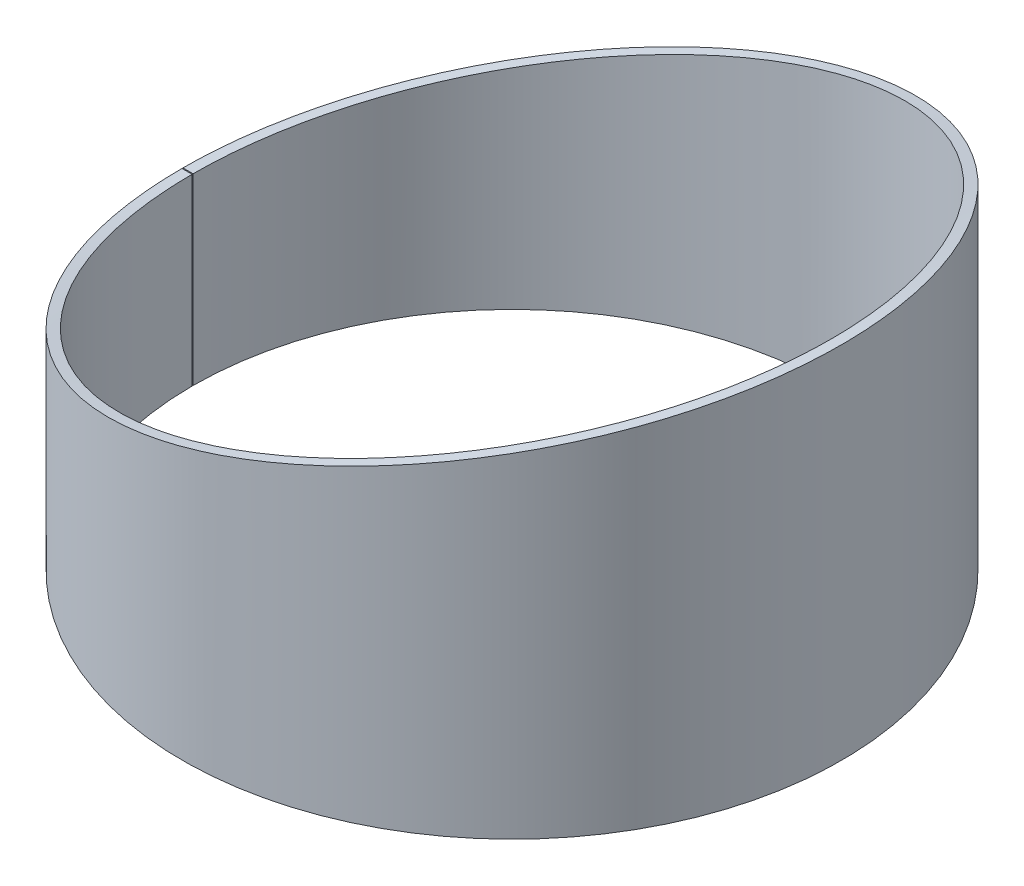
ISO-10303-21;
HEADER;
FILE_DESCRIPTION(('STEP AP214'),'2;1');
FILE_NAME('part.step','',(''),(''),'','','');
FILE_SCHEMA(('AUTOMOTIVE_DESIGN { 1 0 10303 214 1 1 1 1 }'));
ENDSEC;
DATA;
#1=APPLICATION_CONTEXT('core data for automotive mechanical design processes');
#2=APPLICATION_PROTOCOL_DEFINITION('international standard','automotive_design',2000,#1);
#3=PRODUCT_CONTEXT('',#1,'mechanical');
#4=PRODUCT('Part','Part','',(#3));
#5=PRODUCT_RELATED_PRODUCT_CATEGORY('part','',(#4));
#6=PRODUCT_DEFINITION_FORMATION('','',#4);
#7=PRODUCT_DEFINITION_CONTEXT('part definition',#1,'design');
#8=PRODUCT_DEFINITION('design','',#6,#7);
#9=PRODUCT_DEFINITION_SHAPE('','',#8);
#10=(LENGTH_UNIT() NAMED_UNIT(*) SI_UNIT(.MILLI.,.METRE.));
#11=(NAMED_UNIT(*) PLANE_ANGLE_UNIT() SI_UNIT($,.RADIAN.));
#12=(NAMED_UNIT(*) SI_UNIT($,.STERADIAN.) SOLID_ANGLE_UNIT());
#13=UNCERTAINTY_MEASURE_WITH_UNIT(LENGTH_MEASURE(1.E-05),#10,'distance_accuracy_value','');
#14=(GEOMETRIC_REPRESENTATION_CONTEXT(3) GLOBAL_UNCERTAINTY_ASSIGNED_CONTEXT((#13)) GLOBAL_UNIT_ASSIGNED_CONTEXT((#10,
#11,#12)) REPRESENTATION_CONTEXT('',''));
#15=CARTESIAN_POINT('',(0.,0.,0.));
#16=DIRECTION('',(0.,0.,1.));
#17=DIRECTION('',(1.,0.,0.));
#18=AXIS2_PLACEMENT_3D('',#15,#16,#17);
#19=CARTESIAN_POINT('',(-314.999627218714,90.4329039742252,0.484615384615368));
#20=DIRECTION('',(-0.0015384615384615,0.,-0.999998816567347));
#21=DIRECTION('',(0.,-1.,0.));
#22=AXIS2_PLACEMENT_3D('',#19,#20,#21);
#23=PLANE('',#22);
#24=CARTESIAN_POINT('',(-314.999627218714,180.86580794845,0.484615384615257));
#25=CARTESIAN_POINT('',(-324.999615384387,180.86580794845,0.499999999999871));
#26=B_SPLINE_CURVE_WITH_KNOTS('',1,(#24,#25),.UNSPECIFIED.,.F.,.F.,(2,2),(0.,1.),.UNSPECIFIED.);
#27=CARTESIAN_POINT('',(-314.999627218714,180.86580794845,0.484615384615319));
#28=VERTEX_POINT('',#27);
#29=CARTESIAN_POINT('',(-324.999615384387,180.86580794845,0.499999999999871));
#30=VERTEX_POINT('',#29);
#31=EDGE_CURVE('E13',#28,#30,#26,.T.);
#32=ORIENTED_EDGE('',*,*,#31,.F.);
#33=DIRECTION('',(0.,-1.,0.));
#34=VECTOR('',#33,1.);
#35=CARTESIAN_POINT('',(-314.999627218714,180.86580794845,0.484615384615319));
#36=LINE('',#35,#34);
#37=CARTESIAN_POINT('',(-314.999627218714,0.,0.484615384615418));
#38=VERTEX_POINT('',#37);
#39=EDGE_CURVE('E201',#28,#38,#36,.T.);
#40=ORIENTED_EDGE('',*,*,#39,.T.);
#41=DIRECTION('',(-0.999998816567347,0.,0.00153846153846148));
#42=VECTOR('',#41,1.);
#43=CARTESIAN_POINT('',(-314.999627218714,0.,0.484615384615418));
#44=LINE('',#43,#42);
#45=CARTESIAN_POINT('',(-324.999615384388,0.,0.499999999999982));
#46=VERTEX_POINT('',#45);
#47=EDGE_CURVE('E50',#38,#46,#44,.T.);
#48=ORIENTED_EDGE('',*,*,#47,.T.);
#49=DIRECTION('',(0.,-1.,0.));
#50=VECTOR('',#49,1.);
#51=CARTESIAN_POINT('',(-324.999615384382,2190.76139160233,0.499999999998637));
#52=LINE('',#51,#50);
#53=EDGE_CURVE('E101',#30,#46,#52,.T.);
#54=ORIENTED_EDGE('',*,*,#53,.F.);
#55=EDGE_LOOP('',(#32,#40,#48,#54));
#56=FACE_BOUND('',#55,.T.);
#57=ADVANCED_FACE('F36',(#56),#23,.T.);
#58=CARTESIAN_POINT('',(0.,-8.88178419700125E-13,0.));
#59=DIRECTION('',(0.,-1.,0.));
#60=DIRECTION('',(1.,0.,0.));
#61=AXIS2_PLACEMENT_3D('',#58,#59,#60);
#62=PLANE('',#61);
#63=ORIENTED_EDGE('',*,*,#47,.F.);
#64=CARTESIAN_POINT('',(0.,-8.88178419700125E-13,0.));
#65=DIRECTION('',(0.,1.,0.));
#66=DIRECTION('',(-1.,0.,0.));
#67=AXIS2_PLACEMENT_3D('',#64,#65,#66);
#68=CIRCLE('',#67,315.);
#69=CARTESIAN_POINT('',(-314.999627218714,0.,-0.484615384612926));
#70=VERTEX_POINT('',#69);
#71=EDGE_CURVE('E93',#38,#70,#68,.T.);
#72=ORIENTED_EDGE('',*,*,#71,.T.);
#73=DIRECTION('',(-0.999998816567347,0.,-0.0015384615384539));
#74=VECTOR('',#73,1.);
#75=CARTESIAN_POINT('',(-314.999627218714,0.,-0.484615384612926));
#76=LINE('',#75,#74);
#77=CARTESIAN_POINT('',(-324.999615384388,0.,-0.499999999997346));
#78=VERTEX_POINT('',#77);
#79=EDGE_CURVE('E88',#70,#78,#76,.T.);
#80=ORIENTED_EDGE('',*,*,#79,.T.);
#81=CARTESIAN_POINT('',(0.,-8.88178419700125E-13,0.));
#82=DIRECTION('',(0.,-1.,0.));
#83=DIRECTION('',(1.,0.,0.));
#84=AXIS2_PLACEMENT_3D('',#81,#82,#83);
#85=CIRCLE('',#84,325.);
#86=EDGE_CURVE('E91',#46,#78,#85,.F.);
#87=ORIENTED_EDGE('',*,*,#86,.F.);
#88=EDGE_LOOP('',(#63,#72,#80,#87));
#89=FACE_BOUND('',#88,.T.);
#90=ADVANCED_FACE('F90',(#89),#62,.T.);
#91=CARTESIAN_POINT('',(-314.999627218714,90.4329039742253,-0.484615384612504));
#92=DIRECTION('',(0.00153846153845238,0.,-0.999998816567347));
#93=DIRECTION('',(0.,-1.,0.));
#94=AXIS2_PLACEMENT_3D('',#91,#92,#93);
#95=PLANE('',#94);
#96=ORIENTED_EDGE('',*,*,#79,.F.);
#97=DIRECTION('',(0.,-1.,0.));
#98=VECTOR('',#97,1.);
#99=CARTESIAN_POINT('',(-314.999627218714,180.865807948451,-0.48461538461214));
#100=LINE('',#99,#98);
#101=CARTESIAN_POINT('',(-314.999627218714,180.865807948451,-0.484615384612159));
#102=VERTEX_POINT('',#101);
#103=EDGE_CURVE('E102',#102,#70,#100,.T.);
#104=ORIENTED_EDGE('',*,*,#103,.F.);
#105=CARTESIAN_POINT('',(-324.999615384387,180.865807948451,-0.49999999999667));
#106=CARTESIAN_POINT('',(-314.999627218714,180.865807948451,-0.484615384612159));
#107=B_SPLINE_CURVE_WITH_KNOTS('',1,(#105,#106),.UNSPECIFIED.,.F.,.F.,(2,2),(0.,1.),.UNSPECIFIED.);
#108=CARTESIAN_POINT('',(-324.999615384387,180.865807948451,-0.499999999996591));
#109=VERTEX_POINT('',#108);
#110=EDGE_CURVE('E58',#102,#109,#107,.F.);
#111=ORIENTED_EDGE('',*,*,#110,.T.);
#112=DIRECTION('',(0.,-1.,0.));
#113=VECTOR('',#112,1.);
#114=CARTESIAN_POINT('',(-324.999615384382,2190.76139160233,-0.499999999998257));
#115=LINE('',#114,#113);
#116=EDGE_CURVE('E100',#109,#78,#115,.T.);
#117=ORIENTED_EDGE('',*,*,#116,.T.);
#118=EDGE_LOOP('',(#96,#104,#111,#117));
#119=FACE_BOUND('',#118,.T.);
#120=ADVANCED_FACE('F104',(#119),#95,.F.);
#121=CARTESIAN_POINT('',(-324.999615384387,180.86580794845,0.499999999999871));
#122=CARTESIAN_POINT('',(-324.998217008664,180.866792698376,1.40894314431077));
#123=CARTESIAN_POINT('',(-324.993211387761,180.86803752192,2.21549847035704));
#124=CARTESIAN_POINT('',(-324.983722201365,180.870294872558,3.27173876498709));
#125=CARTESIAN_POINT('',(-324.980219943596,180.87111234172,3.59822034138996));
#126=CARTESIAN_POINT('',(-324.972999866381,180.87287731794,4.19998834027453));
#127=CARTESIAN_POINT('',(-324.969395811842,180.87381786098,4.46764783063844));
#128=CARTESIAN_POINT('',(-324.950412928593,180.878931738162,5.77222667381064));
#129=CARTESIAN_POINT('',(-324.930042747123,180.884446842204,6.8265792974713));
#130=CARTESIAN_POINT('',(-324.852440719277,180.905264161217,10.0215376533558));
#131=CARTESIAN_POINT('',(-324.779110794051,180.924869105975,12.1713567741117));
#132=CARTESIAN_POINT('',(-324.49527373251,181.000960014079,18.6082847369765));
#133=CARTESIAN_POINT('',(-324.220290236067,181.074629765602,22.9067738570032));
#134=CARTESIAN_POINT('',(-323.140080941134,181.364059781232,35.7708770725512));
#135=CARTESIAN_POINT('',(-322.078870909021,181.648444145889,44.3248910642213));
#136=CARTESIAN_POINT('',(-319.272260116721,182.400427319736,61.3573057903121));
#137=CARTESIAN_POINT('',(-317.528650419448,182.867709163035,69.8279361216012));
#138=CARTESIAN_POINT('',(-313.347466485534,183.988386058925,86.681888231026));
#139=CARTESIAN_POINT('',(-310.910421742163,184.641461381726,95.0596283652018));
#140=CARTESIAN_POINT('',(-305.342747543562,186.133085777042,111.657645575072));
#141=CARTESIAN_POINT('',(-302.213275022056,186.971333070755,119.87520519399));
#142=CARTESIAN_POINT('',(-295.260325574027,188.834558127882,136.103888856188));
#143=CARTESIAN_POINT('',(-291.426604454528,189.862132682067,144.13828756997));
#144=CARTESIAN_POINT('',(-283.04075497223,192.109205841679,159.978882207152));
#145=CARTESIAN_POINT('',(-278.488607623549,193.328704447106,167.785059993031));
#146=CARTESIAN_POINT('',(-268.668569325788,195.959625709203,183.098145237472));
#147=CARTESIAN_POINT('',(-263.402414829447,197.3709520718,190.605579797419));
#148=CARTESIAN_POINT('',(-252.083421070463,200.404315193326,205.341832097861));
#149=CARTESIAN_POINT('',(-246.038503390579,202.024004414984,212.55737595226));
#150=CARTESIAN_POINT('',(-236.393260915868,204.608049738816,223.082657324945));
#151=CARTESIAN_POINT('',(-233.081947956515,205.495150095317,226.541373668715));
#152=CARTESIAN_POINT('',(-226.267897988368,207.320854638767,233.347437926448));
#153=CARTESIAN_POINT('',(-222.761559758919,208.260504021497,236.698820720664));
#154=CARTESIAN_POINT('',(-211.898205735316,211.171859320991,246.617775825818));
#155=CARTESIAN_POINT('',(-204.21289253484,213.231380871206,253.033634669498));
#156=CARTESIAN_POINT('',(-192.017997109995,216.498590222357,262.259547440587));
#157=CARTESIAN_POINT('',(-187.84201294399,217.617314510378,265.268460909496));
#158=CARTESIAN_POINT('',(-179.269365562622,219.914072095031,271.135524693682));
#159=CARTESIAN_POINT('',(-174.876685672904,221.091141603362,273.991732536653));
#160=CARTESIAN_POINT('',(-165.811726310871,223.52014412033,279.570735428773));
#161=CARTESIAN_POINT('',(-161.146200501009,224.770251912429,282.288612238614));
#162=CARTESIAN_POINT('',(-151.549267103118,227.341680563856,287.554826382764));
#163=CARTESIAN_POINT('',(-146.620944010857,228.662259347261,290.102386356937));
#164=CARTESIAN_POINT('',(-136.420959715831,231.395396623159,295.036298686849));
#165=CARTESIAN_POINT('',(-131.158562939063,232.80540569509,297.417275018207));
#166=CARTESIAN_POINT('',(-123.021860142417,234.985579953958,300.830970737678));
#167=CARTESIAN_POINT('',(-120.271608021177,235.722516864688,301.941742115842));
#168=CARTESIAN_POINT('',(-114.653834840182,237.227850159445,304.119340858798));
#169=CARTESIAN_POINT('',(-111.79046710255,237.995117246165,305.184341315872));
#170=CARTESIAN_POINT('',(-105.954560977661,239.558852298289,307.259209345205));
#171=CARTESIAN_POINT('',(-102.982021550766,240.355320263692,308.269076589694));
#172=CARTESIAN_POINT('',(-96.9279096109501,241.977457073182,310.225886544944));
#173=CARTESIAN_POINT('',(-93.8551189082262,242.800772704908,311.170314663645));
#174=CARTESIAN_POINT('',(-84.4106718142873,245.331484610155,313.915324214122));
#175=CARTESIAN_POINT('',(-77.7679337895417,247.111512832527,315.639736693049));
#176=CARTESIAN_POINT('',(-69.030252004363,249.452656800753,317.589405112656));
#177=CARTESIAN_POINT('',(-67.261032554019,249.926691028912,317.969017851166));
#178=CARTESIAN_POINT('',(-63.6793237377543,250.886370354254,318.705642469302));
#179=CARTESIAN_POINT('',(-61.8756445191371,251.36965303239,319.061062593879));
#180=CARTESIAN_POINT('',(-56.314932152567,252.859720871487,320.106008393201));
#181=CARTESIAN_POINT('',(-52.4146112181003,253.90494565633,320.772271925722));
#182=CARTESIAN_POINT('',(-44.2260872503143,256.099087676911,322.003408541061));
#183=CARTESIAN_POINT('',(-39.9378598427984,257.248004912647,322.568278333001));
#184=CARTESIAN_POINT('',(-34.3358364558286,258.748959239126,323.183107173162));
#185=CARTESIAN_POINT('',(-33.2033523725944,259.052390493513,323.301500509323));
#186=CARTESIAN_POINT('',(-31.4865444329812,259.512397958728,323.471680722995));
#187=CARTESIAN_POINT('',(-30.9182074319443,259.664678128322,323.526540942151));
#188=CARTESIAN_POINT('',(-29.7263578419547,259.984064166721,323.63822687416));
#189=CARTESIAN_POINT('',(-29.1055992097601,260.150428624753,323.694739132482));
#190=CARTESIAN_POINT('',(-25.87749477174,261.01560810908,323.978511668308));
#191=CARTESIAN_POINT('',(-22.8971305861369,261.814494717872,324.210092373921));
#192=CARTESIAN_POINT('',(-16.1380636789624,263.625753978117,324.616736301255));
#193=CARTESIAN_POINT('',(-12.3592700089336,264.638126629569,324.791796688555));
#194=CARTESIAN_POINT('',(-6.09298807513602,266.316800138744,324.949597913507));
#195=CARTESIAN_POINT('',(-3.90458230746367,266.903043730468,324.984596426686));
#196=CARTESIAN_POINT('',(-0.473039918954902,267.822437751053,325.001668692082));
#197=CARTESIAN_POINT('',(0.709473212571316,268.139301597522,325.001252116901));
#198=CARTESIAN_POINT('',(3.00484837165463,268.754296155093,324.988135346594));
#199=CARTESIAN_POINT('',(4.12809317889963,269.055222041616,324.975639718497));
#200=CARTESIAN_POINT('',(14.0168425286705,271.704412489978,324.816582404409));
#201=CARTESIAN_POINT('',(21.2359532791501,273.638679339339,324.354974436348));
#202=CARTESIAN_POINT('',(28.2954559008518,275.53080152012,323.769013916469));
#203=CARTESIAN_POINT('',(29.6092925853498,275.882940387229,323.650709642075));
#204=CARTESIAN_POINT('',(31.4332806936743,276.371720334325,323.476926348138));
#205=CARTESIAN_POINT('',(32.0148735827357,276.527552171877,323.419841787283));
#206=CARTESIAN_POINT('',(33.1857004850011,276.841267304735,323.301802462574));
#207=CARTESIAN_POINT('',(33.7679809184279,276.997282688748,323.241492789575));
#208=CARTESIAN_POINT('',(36.6637004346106,277.773148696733,322.933739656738));
#209=CARTESIAN_POINT('',(38.9300826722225,278.380366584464,322.667692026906));
#210=CARTESIAN_POINT('',(45.5781936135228,280.161595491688,321.819190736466));
#211=CARTESIAN_POINT('',(49.8087959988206,281.295181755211,321.186512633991));
#212=CARTESIAN_POINT('',(55.8525116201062,282.914711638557,320.17131345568));
#213=CARTESIAN_POINT('',(57.8167427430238,283.441080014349,319.821850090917));
#214=CARTESIAN_POINT('',(61.6447802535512,284.46686692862,319.1061149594));
#215=CARTESIAN_POINT('',(63.5020144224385,284.964508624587,318.741319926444));
#216=CARTESIAN_POINT('',(69.0272050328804,286.444929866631,317.607280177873));
#217=CARTESIAN_POINT('',(72.619986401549,287.407544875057,316.80326991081));
#218=CARTESIAN_POINT('',(79.6235545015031,289.284109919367,315.11595297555));
#219=CARTESIAN_POINT('',(83.0343452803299,290.198059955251,314.232647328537));
#220=CARTESIAN_POINT('',(89.6741931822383,291.977295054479,312.402621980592));
#221=CARTESIAN_POINT('',(92.8921880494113,292.839589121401,311.459442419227));
#222=CARTESIAN_POINT('',(102.372872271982,295.379869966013,308.526443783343));
#223=CARTESIAN_POINT('',(108.464260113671,297.01198489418,306.430607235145));
#224=CARTESIAN_POINT('',(120.187814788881,300.153403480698,302.025002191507));
#225=CARTESIAN_POINT('',(125.807207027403,301.65912242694,299.721917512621));
#226=CARTESIAN_POINT('',(136.736059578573,304.587421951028,294.89647537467));
#227=CARTESIAN_POINT('',(142.029438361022,306.005804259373,292.379283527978));
#228=CARTESIAN_POINT('',(152.27448097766,308.751033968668,287.176756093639));
#229=CARTESIAN_POINT('',(157.23117769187,310.079126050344,284.489641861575));
#230=CARTESIAN_POINT('',(166.883501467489,312.665419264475,278.937083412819));
#231=CARTESIAN_POINT('',(171.569252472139,313.92100219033,276.076518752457));
#232=CARTESIAN_POINT('',(180.660493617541,316.357040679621,270.214800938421));
#233=CARTESIAN_POINT('',(185.07608318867,317.540054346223,267.207598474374));
#234=CARTESIAN_POINT('',(197.990162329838,320.999811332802,257.947910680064));
#235=CARTESIAN_POINT('',(206.131035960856,323.180987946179,251.473150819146));
#236=CARTESIAN_POINT('',(217.638073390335,326.264760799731,241.422050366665));
#237=CARTESIAN_POINT('',(221.356536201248,327.261353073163,238.015109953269));
#238=CARTESIAN_POINT('',(228.560590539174,329.191873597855,231.105960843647));
#239=CARTESIAN_POINT('',(232.048840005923,330.126442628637,227.601718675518));
#240=CARTESIAN_POINT('',(242.223608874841,332.852363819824,216.909080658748));
#241=CARTESIAN_POINT('',(248.600179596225,334.560710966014,209.559371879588));
#242=CARTESIAN_POINT('',(260.53729377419,337.759537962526,194.518631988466));
#243=CARTESIAN_POINT('',(266.091384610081,339.248202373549,186.837679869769));
#244=CARTESIAN_POINT('',(276.422030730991,342.016088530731,171.183540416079));
#245=CARTESIAN_POINT('',(281.209334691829,343.298508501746,163.191982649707));
#246=CARTESIAN_POINT('',(290.023793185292,345.660302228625,146.957519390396));
#247=CARTESIAN_POINT('',(294.05096933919,346.739675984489,138.714635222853));
#248=CARTESIAN_POINT('',(301.348587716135,348.695377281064,122.052248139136));
#249=CARTESIAN_POINT('',(304.625477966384,349.573159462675,113.619938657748));
#250=CARTESIAN_POINT('',(310.452279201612,351.134166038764,96.5689112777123));
#251=CARTESIAN_POINT('',(312.998842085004,351.816551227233,87.9576909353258));
#252=CARTESIAN_POINT('',(317.358631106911,352.98508540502,70.6281091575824));
#253=CARTESIAN_POINT('',(319.170981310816,353.47084823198,61.9175325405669));
#254=CARTESIAN_POINT('',(323.529191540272,354.638252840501,35.6292970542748));
#255=CARTESIAN_POINT('',(324.986854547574,355.029143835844,17.9117801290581));
#256=CARTESIAN_POINT('',(325.012968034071,355.036168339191,-17.431526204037));
#257=CARTESIAN_POINT('',(323.581624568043,354.652277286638,-35.1498757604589));
#258=CARTESIAN_POINT('',(319.262399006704,353.495334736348,-61.4444135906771));
#259=CARTESIAN_POINT('',(317.463068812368,353.013088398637,-70.1570917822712));
#260=CARTESIAN_POINT('',(313.12939062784,351.851545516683,-87.4917271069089));
#261=CARTESIAN_POINT('',(310.595826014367,351.17262676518,-96.1061778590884));
#262=CARTESIAN_POINT('',(304.794738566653,349.618494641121,-113.165064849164));
#263=CARTESIAN_POINT('',(301.530267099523,348.744053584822,-121.602613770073));
#264=CARTESIAN_POINT('',(294.258676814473,346.795357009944,-138.273384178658));
#265=CARTESIAN_POINT('',(290.244500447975,345.719463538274,-146.521045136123));
#266=CARTESIAN_POINT('',(281.455905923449,343.364586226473,-162.766273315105));
#267=CARTESIAN_POINT('',(276.681466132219,342.085602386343,-170.763819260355));
#268=CARTESIAN_POINT('',(266.376296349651,339.324544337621,-186.431178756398));
#269=CARTESIAN_POINT('',(260.836345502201,337.839670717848,-194.117272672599));
#270=CARTESIAN_POINT('',(248.926753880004,334.648201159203,-209.171187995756));
#271=CARTESIAN_POINT('',(242.563979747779,332.943540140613,-216.528222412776));
#272=CARTESIAN_POINT('',(232.409842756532,330.223159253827,-227.233038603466));
#273=CARTESIAN_POINT('',(228.928171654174,329.290366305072,-230.741777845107));
#274=CARTESIAN_POINT('',(221.739942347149,327.364108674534,-237.657892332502));
#275=CARTESIAN_POINT('',(218.029403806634,326.369640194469,-241.068628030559));
#276=CARTESIAN_POINT('',(206.546110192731,323.292215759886,-251.132080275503));
#277=CARTESIAN_POINT('',(198.42102858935,321.115240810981,-257.616364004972));
#278=CARTESIAN_POINT('',(185.530297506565,317.661740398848,-266.892361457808));
#279=CARTESIAN_POINT('',(181.121529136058,316.480574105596,-269.905890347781));
#280=CARTESIAN_POINT('',(172.04888551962,314.049526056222,-275.777770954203));
#281=CARTESIAN_POINT('',(167.372361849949,312.796410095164,-278.643927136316));
#282=CARTESIAN_POINT('',(157.738263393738,310.214994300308,-284.208701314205));
#283=CARTESIAN_POINT('',(152.790008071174,308.889171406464,-286.902666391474));
#284=CARTESIAN_POINT('',(142.566889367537,306.149820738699,-292.117456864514));
#285=CARTESIAN_POINT('',(137.284359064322,304.734336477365,-294.641487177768));
#286=CARTESIAN_POINT('',(126.376845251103,301.811750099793,-299.48204319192));
#287=CARTESIAN_POINT('',(120.769475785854,300.309268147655,-301.792666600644));
#288=CARTESIAN_POINT('',(109.074441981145,297.175485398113,-306.213726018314));
#289=CARTESIAN_POINT('',(102.997115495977,295.547124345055,-308.31839250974));
#290=CARTESIAN_POINT('',(93.5370512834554,293.012378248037,-311.266331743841));
#291=CARTESIAN_POINT('',(90.3300323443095,292.153036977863,-312.213513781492));
#292=CARTESIAN_POINT('',(83.7126477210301,290.379820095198,-314.052520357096));
#293=CARTESIAN_POINT('',(80.3130151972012,289.468853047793,-314.940829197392));
#294=CARTESIAN_POINT('',(73.3315591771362,287.598201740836,-316.639209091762));
#295=CARTESIAN_POINT('',(69.7497316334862,286.638517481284,-317.449279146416));
#296=CARTESIAN_POINT('',(64.2407702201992,285.162453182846,-318.593221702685));
#297=CARTESIAN_POINT('',(62.3909021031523,284.666795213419,-318.961001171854));
#298=CARTESIAN_POINT('',(58.5881638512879,283.647800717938,-319.681360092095));
#299=CARTESIAN_POINT('',(56.636552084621,283.124814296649,-320.033475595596));
#300=CARTESIAN_POINT('',(50.6305733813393,281.515387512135,-321.057694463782));
#301=CARTESIAN_POINT('',(46.4249689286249,280.388479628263,-321.697803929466));
#302=CARTESIAN_POINT('',(39.8139668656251,278.617182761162,-322.559741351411));
#303=CARTESIAN_POINT('',(37.559889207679,278.013261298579,-322.83064907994));
#304=CARTESIAN_POINT('',(34.1033631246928,277.087145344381,-323.207833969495));
#305=CARTESIAN_POINT('',(32.93862121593,276.775067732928,-323.328697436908));
#306=CARTESIAN_POINT('',(30.5840603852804,276.144167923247,-323.559908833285));
#307=CARTESIAN_POINT('',(29.3320687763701,275.808633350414,-323.676526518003));
#308=CARTESIAN_POINT('',(22.5308387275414,273.985764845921,-324.264069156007));
#309=CARTESIAN_POINT('',(15.5264862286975,272.108791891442,-324.742042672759));
#310=CARTESIAN_POINT('',(4.81489875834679,269.239228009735,-324.97139624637));
#311=CARTESIAN_POINT('',(2.57476676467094,268.639100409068,-324.998203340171));
#312=CARTESIAN_POINT('',(-2.099244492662,267.38670026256,-325.001622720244));
#313=CARTESIAN_POINT('',(-4.33756073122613,266.787061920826,-324.978097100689));
#314=CARTESIAN_POINT('',(-10.7551842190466,265.067832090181,-324.850177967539));
#315=CARTESIAN_POINT('',(-14.6370073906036,264.02792579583,-324.688984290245));
#316=CARTESIAN_POINT('',(-21.6056923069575,262.160607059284,-324.299818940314));
#317=CARTESIAN_POINT('',(-24.6926469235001,261.33319461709,-324.071851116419));
#318=CARTESIAN_POINT('',(-28.728660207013,260.251446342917,-323.73057772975));
#319=CARTESIAN_POINT('',(-29.970611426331,259.918591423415,-323.617214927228));
#320=CARTESIAN_POINT('',(-32.2745769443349,259.301245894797,-323.395564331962));
#321=CARTESIAN_POINT('',(-33.4144998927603,258.995817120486,-323.279689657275));
#322=CARTESIAN_POINT('',(-39.0536814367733,257.484893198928,-322.676920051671));
#323=CARTESIAN_POINT('',(-43.3715172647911,256.328057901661,-322.119988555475));
#324=CARTESIAN_POINT('',(-51.6188088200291,254.118194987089,-320.901658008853));
#325=CARTESIAN_POINT('',(-55.548289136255,253.065167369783,-320.240262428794));
#326=CARTESIAN_POINT('',(-61.1522868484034,251.563481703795,-319.200575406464));
#327=CARTESIAN_POINT('',(-62.9653650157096,251.077670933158,-318.847502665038));
#328=CARTESIAN_POINT('',(-66.5617184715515,250.114062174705,-318.116181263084));
#329=CARTESIAN_POINT('',(-68.3382420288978,249.638070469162,-317.739066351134));
#330=CARTESIAN_POINT('',(-77.1123336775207,247.28717530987,-315.801142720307));
#331=CARTESIAN_POINT('',(-83.7838395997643,245.499461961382,-314.083744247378));
#332=CARTESIAN_POINT('',(-93.2705941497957,242.957396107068,-311.346155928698));
#333=CARTESIAN_POINT('',(-96.3519845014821,242.131769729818,-310.405331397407));
#334=CARTESIAN_POINT('',(-102.425906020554,240.504325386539,-308.454386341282));
#335=CARTESIAN_POINT('',(-105.408288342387,239.705223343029,-307.447126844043));
#336=CARTESIAN_POINT('',(-111.263731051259,238.136259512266,-305.376857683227));
#337=CARTESIAN_POINT('',(-114.136792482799,237.366397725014,-304.313848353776));
#338=CARTESIAN_POINT('',(-119.773781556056,235.855914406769,-302.139648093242));
#339=CARTESIAN_POINT('',(-122.533182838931,235.11651964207,-301.03041090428));
#340=CARTESIAN_POINT('',(-130.693287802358,232.930069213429,-297.622279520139));
#341=CARTESIAN_POINT('',(-135.971058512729,231.515947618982,-295.244154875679));
#342=CARTESIAN_POINT('',(-146.201225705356,228.774728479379,-290.314383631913));
#343=CARTESIAN_POINT('',(-151.144143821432,227.450230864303,-287.768175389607));
#344=CARTESIAN_POINT('',(-160.766960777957,224.871865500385,-282.504972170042));
#345=CARTESIAN_POINT('',(-165.445201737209,223.618355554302,-279.787993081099));
#346=CARTESIAN_POINT('',(-174.535071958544,221.182681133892,-274.20967252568));
#347=CARTESIAN_POINT('',(-178.93964968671,220.002414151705,-271.353407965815));
#348=CARTESIAN_POINT('',(-187.533891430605,217.699859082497,-265.486552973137));
#349=CARTESIAN_POINT('',(-191.720436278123,216.578306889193,-262.477320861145));
#350=CARTESIAN_POINT('',(-203.946247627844,213.302826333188,-253.249297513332));
#351=CARTESIAN_POINT('',(-211.651146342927,211.238073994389,-246.830492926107));
#352=CARTESIAN_POINT('',(-226.172529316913,207.346372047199,-233.596847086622));
#353=CARTESIAN_POINT('',(-232.984404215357,205.521308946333,-226.790913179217));
#354=CARTESIAN_POINT('',(-245.875136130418,202.067763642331,-212.746958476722));
#355=CARTESIAN_POINT('',(-251.934247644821,200.444275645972,-205.525426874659));
#356=CARTESIAN_POINT('',(-263.279558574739,197.403868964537,-190.775890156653));
#357=CARTESIAN_POINT('',(-268.557804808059,195.989308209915,-183.261159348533));
#358=CARTESIAN_POINT('',(-278.39939432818,193.35261653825,-167.933690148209));
#359=CARTESIAN_POINT('',(-282.961371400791,192.130481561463,-160.119874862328));
#360=CARTESIAN_POINT('',(-291.365019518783,189.878633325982,-144.263430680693));
#361=CARTESIAN_POINT('',(-295.206709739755,188.848920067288,-136.220820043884));
#362=CARTESIAN_POINT('',(-302.17380692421,186.981915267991,-119.975429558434));
#363=CARTESIAN_POINT('',(-305.309352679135,186.142045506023,-111.749700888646));
#364=CARTESIAN_POINT('',(-310.887815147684,184.647531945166,-95.134446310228));
#365=CARTESIAN_POINT('',(-313.329472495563,183.993218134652,-86.7478710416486));
#366=CARTESIAN_POINT('',(-317.51833492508,182.870476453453,-69.8760220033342));
#367=CARTESIAN_POINT('',(-319.264989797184,182.402374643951,-61.3964942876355));
#368=CARTESIAN_POINT('',(-322.076346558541,181.649126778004,-44.3451260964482));
#369=CARTESIAN_POINT('',(-323.139197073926,181.364292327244,-35.78152068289));
#370=CARTESIAN_POINT('',(-324.220778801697,181.074496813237,-22.9008967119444));
#371=CARTESIAN_POINT('',(-324.496028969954,181.000754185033,-18.5966425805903));
#372=CARTESIAN_POINT('',(-324.732622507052,180.937332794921,-13.2242438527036));
#373=CARTESIAN_POINT('',(-324.774565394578,180.926089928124,-12.1504857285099));
#374=CARTESIAN_POINT('',(-324.847752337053,180.906487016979,-10.00452059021));
#375=CARTESIAN_POINT('',(-324.879113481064,180.898123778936,-8.9270838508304));
#376=CARTESIAN_POINT('',(-324.930582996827,180.884296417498,-6.80054671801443));
#377=CARTESIAN_POINT('',(-324.950662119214,180.87883460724,-5.75523621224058));
#378=CARTESIAN_POINT('',(-324.96934480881,180.873822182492,-4.47111918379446));
#379=CARTESIAN_POINT('',(-324.972897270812,180.872901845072,-4.20773973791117));
#380=CARTESIAN_POINT('',(-324.980075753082,180.871161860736,-3.61101063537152));
#381=CARTESIAN_POINT('',(-324.983579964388,180.870351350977,-3.28582840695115));
#382=CARTESIAN_POINT('',(-324.993113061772,180.868098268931,-2.22982545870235));
#383=CARTESIAN_POINT('',(-324.998202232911,180.866834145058,-1.41854737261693));
#384=CARTESIAN_POINT('',(-324.999615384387,180.865807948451,-0.49999999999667));
#385=CARTESIAN_POINT('',(-314.999627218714,180.86580794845,0.484615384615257));
#386=CARTESIAN_POINT('',(-314.998271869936,180.866792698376,1.36559104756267));
#387=CARTESIAN_POINT('',(-314.993420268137,180.86803752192,2.14732928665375));
#388=CARTESIAN_POINT('',(-314.984223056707,180.870294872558,3.17106987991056));
#389=CARTESIAN_POINT('',(-314.980828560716,180.87111234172,3.48750586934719));
#390=CARTESIAN_POINT('',(-314.973830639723,180.87287731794,4.07075792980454));
#391=CARTESIAN_POINT('',(-314.97033747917,180.87381786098,4.33018174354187));
#392=CARTESIAN_POINT('',(-314.951938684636,180.878931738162,5.59461969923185));
#393=CARTESIAN_POINT('',(-314.932195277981,180.884446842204,6.61653070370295));
#394=CARTESIAN_POINT('',(-314.856981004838,180.905264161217,9.71318264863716));
#395=CARTESIAN_POINT('',(-314.785907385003,180.924869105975,11.7968534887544));
#396=CARTESIAN_POINT('',(-314.51080377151,181.000960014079,18.0357221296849));
#397=CARTESIAN_POINT('',(-314.244281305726,181.074629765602,22.2019500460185));
#398=CARTESIAN_POINT('',(-313.197309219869,181.364059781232,34.6702347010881));
#399=CARTESIAN_POINT('',(-312.168751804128,181.648444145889,42.9610482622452));
#400=CARTESIAN_POINT('',(-309.448498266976,182.400427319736,59.4693886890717));
#401=CARTESIAN_POINT('',(-307.75853809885,182.867709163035,67.6793842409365));
#402=CARTESIAN_POINT('',(-303.706005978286,183.988386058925,84.0147532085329));
#403=CARTESIAN_POINT('',(-301.343947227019,184.641461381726,92.1347167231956));
#404=CARTESIAN_POINT('',(-295.947586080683,186.133085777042,108.222025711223));
#405=CARTESIAN_POINT('',(-292.914405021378,186.971333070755,116.186737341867));
#406=CARTESIAN_POINT('',(-286.175392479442,188.834558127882,131.916076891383));
#407=CARTESIAN_POINT('',(-282.459632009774,189.862132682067,139.703263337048));
#408=CARTESIAN_POINT('',(-274.331808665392,192.109205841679,155.056455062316));
#409=CARTESIAN_POINT('',(-269.919727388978,193.328704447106,162.622442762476));
#410=CARTESIAN_POINT('',(-260.401844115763,195.959625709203,177.464356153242));
#411=CARTESIAN_POINT('',(-255.297725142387,197.3709520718,184.740792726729));
#412=CARTESIAN_POINT('',(-244.327008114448,200.404315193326,199.023621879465));
#413=CARTESIAN_POINT('',(-238.468087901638,202.024004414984,206.017148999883));
#414=CARTESIAN_POINT('',(-229.119622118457,204.608049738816,216.2185755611));
#415=CARTESIAN_POINT('',(-225.910195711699,205.495150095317,219.570869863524));
#416=CARTESIAN_POINT('',(-219.305808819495,207.320854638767,226.16751675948));
#417=CARTESIAN_POINT('',(-215.907357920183,208.260504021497,229.415780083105));
#418=CARTESIAN_POINT('',(-205.37826094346,211.171859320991,239.029536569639));
#419=CARTESIAN_POINT('',(-197.929418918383,213.231380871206,245.247984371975));
#420=CARTESIAN_POINT('',(-186.109751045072,216.498590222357,254.190022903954));
#421=CARTESIAN_POINT('',(-182.062258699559,217.617314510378,257.106354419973));
#422=CARTESIAN_POINT('',(-173.753385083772,219.914072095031,262.792893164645));
#423=CARTESIAN_POINT('',(-169.495864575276,221.091141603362,265.561217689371));
#424=CARTESIAN_POINT('',(-160.709827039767,223.52014412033,270.968558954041));
#425=CARTESIAN_POINT('',(-156.187855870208,224.770251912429,273.602808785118));
#426=CARTESIAN_POINT('',(-146.886212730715,227.341680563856,278.706985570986));
#427=CARTESIAN_POINT('',(-142.109530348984,228.662259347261,281.176159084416));
#428=CARTESIAN_POINT('',(-132.223391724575,231.395396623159,285.958258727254));
#429=CARTESIAN_POINT('',(-127.12291484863,232.80540569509,288.265974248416));
#430=CARTESIAN_POINT('',(-119.236572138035,234.985579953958,291.574633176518));
#431=CARTESIAN_POINT('',(-116.570943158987,235.722516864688,292.651226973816));
#432=CARTESIAN_POINT('',(-111.126024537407,237.227850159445,294.761822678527));
#433=CARTESIAN_POINT('',(-108.350760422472,237.995117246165,295.794053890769));
#434=CARTESIAN_POINT('',(-102.694420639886,239.558852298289,297.805079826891));
#435=CARTESIAN_POINT('',(-99.8133439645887,240.355320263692,298.783874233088));
#436=CARTESIAN_POINT('',(-93.9455123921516,241.977457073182,300.680474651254));
#437=CARTESIAN_POINT('',(-90.9672690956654,242.800772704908,301.595843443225));
#438=CARTESIAN_POINT('',(-81.8134203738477,245.331484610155,304.25639116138));
#439=CARTESIAN_POINT('',(-75.375074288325,247.111512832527,305.927744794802));
#440=CARTESIAN_POINT('',(-66.9062442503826,249.452656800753,307.817423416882));
#441=CARTESIAN_POINT('',(-65.1914623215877,249.926691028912,308.185355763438));
#442=CARTESIAN_POINT('',(-61.7199599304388,250.886370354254,308.899315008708));
#443=CARTESIAN_POINT('',(-59.9717785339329,251.36965303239,309.243799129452));
#444=CARTESIAN_POINT('',(-54.5821650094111,252.859720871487,310.256592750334));
#445=CARTESIAN_POINT('',(-50.8018539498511,253.90494565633,310.902355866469));
#446=CARTESIAN_POINT('',(-42.8652845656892,256.099087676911,312.095611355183));
#447=CARTESIAN_POINT('',(-38.7090026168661,257.248004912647,312.64310053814));
#448=CARTESIAN_POINT('',(-33.2793491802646,258.748959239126,313.239011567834));
#449=CARTESIAN_POINT('',(-32.1817107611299,259.052390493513,313.353762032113));
#450=CARTESIAN_POINT('',(-30.5177276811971,259.512397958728,313.518705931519));
#451=CARTESIAN_POINT('',(-29.9668779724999,259.664678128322,313.571878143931));
#452=CARTESIAN_POINT('',(-28.8117006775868,259.984064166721,313.680127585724));
#453=CARTESIAN_POINT('',(-28.2100423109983,260.150428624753,313.734901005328));
#454=CARTESIAN_POINT('',(-25.0812641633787,261.01560810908,314.009942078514));
#455=CARTESIAN_POINT('',(-22.1926034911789,261.814494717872,314.234397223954));
#456=CARTESIAN_POINT('',(-15.6415078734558,263.625753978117,314.628529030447));
#457=CARTESIAN_POINT('',(-11.9789847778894,264.638126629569,314.798202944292));
#458=CARTESIAN_POINT('',(-5.90551151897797,266.316800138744,314.951148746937));
#459=CARTESIAN_POINT('',(-3.78444131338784,266.903043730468,314.985070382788));
#460=CARTESIAN_POINT('',(-0.458484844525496,267.822437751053,315.00161734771));
#461=CARTESIAN_POINT('',(0.687643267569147,268.139301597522,315.001213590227));
#462=CARTESIAN_POINT('',(2.91239149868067,268.754296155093,314.988500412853));
#463=CARTESIAN_POINT('',(4.0010749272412,269.055222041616,314.97638926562));
#464=CARTESIAN_POINT('',(13.5855550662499,271.704412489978,314.822226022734));
#465=CARTESIAN_POINT('',(20.5825393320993,273.638679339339,314.374821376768));
#466=CARTESIAN_POINT('',(27.424826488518,275.53080152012,313.806890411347));
#467=CARTESIAN_POINT('',(28.6982374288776,275.882940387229,313.692226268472));
#468=CARTESIAN_POINT('',(30.4661028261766,276.371720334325,313.523790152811));
#469=CARTESIAN_POINT('',(31.0298005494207,276.527552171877,313.468462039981));
#470=CARTESIAN_POINT('',(32.1646020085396,276.841267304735,313.354054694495));
#471=CARTESIAN_POINT('',(32.7289661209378,276.997282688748,313.295600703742));
#472=CARTESIAN_POINT('',(35.5355865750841,277.773148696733,312.997316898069));
#473=CARTESIAN_POINT('',(37.7322339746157,278.380366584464,312.739455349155));
#474=CARTESIAN_POINT('',(44.1757876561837,280.161595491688,311.917061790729));
#475=CARTESIAN_POINT('',(48.2762176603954,281.295181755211,311.303850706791));
#476=CARTESIAN_POINT('',(54.133972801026,282.914711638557,310.319888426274));
#477=CARTESIAN_POINT('',(56.0377660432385,283.441080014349,309.981177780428));
#478=CARTESIAN_POINT('',(59.7480177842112,284.46686692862,309.287465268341));
#479=CARTESIAN_POINT('',(61.5481062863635,284.964508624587,308.933894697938));
#480=CARTESIAN_POINT('',(66.9032910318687,286.444929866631,307.834748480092));
#481=CARTESIAN_POINT('',(70.3855252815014,287.407544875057,307.055476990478));
#482=CARTESIAN_POINT('',(77.1735989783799,289.284109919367,305.420077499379));
#483=CARTESIAN_POINT('',(80.4794423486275,290.198059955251,304.563950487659));
#484=CARTESIAN_POINT('',(86.9149872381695,291.977295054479,302.790233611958));
#485=CARTESIAN_POINT('',(90.0339668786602,292.839589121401,301.876074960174));
#486=CARTESIAN_POINT('',(99.2229377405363,295.379869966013,299.033322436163));
#487=CARTESIAN_POINT('',(105.126898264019,297.01198489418,297.001973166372));
#488=CARTESIAN_POINT('',(116.489728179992,300.153403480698,292.731925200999));
#489=CARTESIAN_POINT('',(121.936216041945,301.65912242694,290.499704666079));
#490=CARTESIAN_POINT('',(132.528796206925,304.587421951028,285.822737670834));
#491=CARTESIAN_POINT('',(137.659301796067,306.005804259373,283.382997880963));
#492=CARTESIAN_POINT('',(147.589112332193,308.751033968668,278.340548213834));
#493=CARTESIAN_POINT('',(152.393295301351,310.079126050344,275.73611441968));
#494=CARTESIAN_POINT('',(161.748624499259,312.665419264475,270.354403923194));
#495=CARTESIAN_POINT('',(166.290198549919,313.92100219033,267.581856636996));
#496=CARTESIAN_POINT('',(175.10170919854,316.357040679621,261.900499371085));
#497=CARTESIAN_POINT('',(179.381434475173,317.540054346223,258.985826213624));
#498=CARTESIAN_POINT('',(191.898157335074,320.999811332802,250.011051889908));
#499=CARTESIAN_POINT('',(199.788542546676,323.180987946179,243.735515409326));
#500=CARTESIAN_POINT('',(210.941517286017,326.264760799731,233.993679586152));
#501=CARTESIAN_POINT('',(214.545565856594,327.261353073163,230.691568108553));
#502=CARTESIAN_POINT('',(221.527956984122,329.191873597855,223.995008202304));
#503=CARTESIAN_POINT('',(224.908875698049,330.126442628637,220.598588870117));
#504=CARTESIAN_POINT('',(234.770574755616,332.852363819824,210.234955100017));
#505=CARTESIAN_POINT('',(240.950943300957,334.560710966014,203.11139120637));
#506=CARTESIAN_POINT('',(252.520761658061,337.759537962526,188.533443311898));
#507=CARTESIAN_POINT('',(257.903957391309,339.248202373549,181.088828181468));
#508=CARTESIAN_POINT('',(267.91673747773,342.016088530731,165.916354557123));
#509=CARTESIAN_POINT('',(272.556739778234,343.298508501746,158.17069087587));
#510=CARTESIAN_POINT('',(281.099984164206,345.660302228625,142.435749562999));
#511=CARTESIAN_POINT('',(285.003247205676,346.739675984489,134.446492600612));
#512=CARTESIAN_POINT('',(292.076323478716,348.695377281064,118.296794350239));
#513=CARTESIAN_POINT('',(295.252386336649,349.573159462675,110.123940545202));
#514=CARTESIAN_POINT('',(300.899901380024,351.134166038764,93.597560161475));
#515=CARTESIAN_POINT('',(303.368108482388,351.816551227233,85.2513004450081));
#516=CARTESIAN_POINT('',(307.593750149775,352.98508540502,68.4549365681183));
#517=CARTESIAN_POINT('',(309.350335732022,353.47084823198,60.0123776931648));
#518=CARTESIAN_POINT('',(313.574447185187,354.638252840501,34.5330109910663));
#519=CARTESIAN_POINT('',(314.987259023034,355.029143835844,17.3606484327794));
#520=CARTESIAN_POINT('',(315.012569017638,355.036168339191,-16.8951715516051));
#521=CARTESIAN_POINT('',(313.625266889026,354.652277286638,-34.0683411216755));
#522=CARTESIAN_POINT('',(309.438940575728,353.495334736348,-59.5538162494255));
#523=CARTESIAN_POINT('',(307.694974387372,353.013088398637,-67.9984120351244));
#524=CARTESIAN_POINT('',(303.494640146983,351.851545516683,-84.7996739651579));
#525=CARTESIAN_POINT('',(301.039031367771,351.17262676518,-93.1490646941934));
#526=CARTESIAN_POINT('',(295.416438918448,349.618494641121,-109.683062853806));
#527=CARTESIAN_POINT('',(292.25241272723,348.744053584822,-117.86099488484));
#528=CARTESIAN_POINT('',(285.20456368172,346.795357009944,-134.018818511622));
#529=CARTESIAN_POINT('',(281.313900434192,345.719463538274,-142.012705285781));
#530=CARTESIAN_POINT('',(272.795724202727,343.364586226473,-157.758080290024));
#531=CARTESIAN_POINT('',(268.168190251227,342.085602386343,-165.509547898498));
#532=CARTESIAN_POINT('',(258.180102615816,339.324544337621,-180.694834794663));
#533=CARTESIAN_POINT('',(252.810611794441,337.839670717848,-188.144433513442));
#534=CARTESIAN_POINT('',(241.267469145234,334.648201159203,-202.73515144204));
#535=CARTESIAN_POINT('',(235.100472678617,332.943540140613,-209.865815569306));
#536=CARTESIAN_POINT('',(225.258770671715,330.223159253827,-220.241252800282));
#537=CARTESIAN_POINT('',(221.884227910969,329.290366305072,-223.642030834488));
#538=CARTESIAN_POINT('',(214.917174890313,327.364108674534,-230.345341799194));
#539=CARTESIAN_POINT('',(211.32080676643,326.369640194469,-233.651131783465));
#540=CARTESIAN_POINT('',(200.190845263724,323.292215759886,-243.404939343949));
#541=CARTESIAN_POINT('',(192.315766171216,321.115240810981,-249.689706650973));
#542=CARTESIAN_POINT('',(179.821672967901,317.661740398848,-258.680288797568));
#543=CARTESIAN_POINT('',(175.548559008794,316.480574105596,-261.601093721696));
#544=CARTESIAN_POINT('',(166.755073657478,314.049526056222,-267.292301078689));
#545=CARTESIAN_POINT('',(162.222443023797,312.796410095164,-270.070267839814));
#546=CARTESIAN_POINT('',(152.884778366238,310.214994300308,-275.463818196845));
#547=CARTESIAN_POINT('',(148.088777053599,308.889171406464,-278.074892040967));
#548=CARTESIAN_POINT('',(138.180215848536,306.149820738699,-283.129227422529));
#549=CARTESIAN_POINT('',(133.060224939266,304.734336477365,-285.575595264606));
#550=CARTESIAN_POINT('',(122.488326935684,301.811750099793,-290.267211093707));
#551=CARTESIAN_POINT('',(117.05349191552,300.309268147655,-292.506738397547));
#552=CARTESIAN_POINT('',(105.718305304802,297.175485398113,-296.79176521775));
#553=CARTESIAN_POINT('',(99.8279734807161,295.547124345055,-298.831672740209));
#554=CARTESIAN_POINT('',(90.6589881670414,293.012378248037,-301.688906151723));
#555=CARTESIAN_POINT('',(87.5506467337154,292.153036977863,-302.606944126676));
#556=CARTESIAN_POINT('',(81.1368739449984,290.379820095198,-304.38936588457));
#557=CARTESIAN_POINT('',(77.8418454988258,289.468853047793,-305.250342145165));
#558=CARTESIAN_POINT('',(71.0752035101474,287.598201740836,-306.896464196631));
#559=CARTESIAN_POINT('',(67.6035860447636,286.638517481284,-307.681609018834));
#560=CARTESIAN_POINT('',(62.2641311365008,285.162453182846,-308.790353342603));
#561=CARTESIAN_POINT('',(60.4711820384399,284.666795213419,-309.146816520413));
#562=CARTESIAN_POINT('',(56.7854511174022,283.647800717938,-309.845010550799));
#563=CARTESIAN_POINT('',(54.8938889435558,283.124814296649,-310.186291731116));
#564=CARTESIAN_POINT('',(49.0727095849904,281.515387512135,-311.178996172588));
#565=CARTESIAN_POINT('',(44.9965083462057,280.388479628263,-311.799409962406));
#566=CARTESIAN_POINT('',(38.5889217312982,278.617182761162,-312.634826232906));
#567=CARTESIAN_POINT('',(36.4042003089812,278.013261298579,-312.897398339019));
#568=CARTESIAN_POINT('',(33.0540288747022,277.087145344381,-313.262977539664));
#569=CARTESIAN_POINT('',(31.9251251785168,276.775067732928,-313.380122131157));
#570=CARTESIAN_POINT('',(29.6430123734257,276.144167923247,-313.604219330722));
#571=CARTESIAN_POINT('',(28.4295435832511,275.808633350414,-313.717248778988));
#572=CARTESIAN_POINT('',(21.8375821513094,273.985764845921,-314.286713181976));
#573=CARTESIAN_POINT('',(15.0487481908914,272.108791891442,-314.74997982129));
#574=CARTESIAN_POINT('',(4.66674802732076,269.239228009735,-314.972276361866));
#575=CARTESIAN_POINT('',(2.49554317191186,268.639100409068,-314.998258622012));
#576=CARTESIAN_POINT('',(-2.03465235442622,267.38670026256,-315.00157279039));
#577=CARTESIAN_POINT('',(-4.20409732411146,266.787061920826,-314.978771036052));
#578=CARTESIAN_POINT('',(-10.4242554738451,265.067832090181,-314.85478787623));
#579=CARTESIAN_POINT('',(-14.1866379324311,264.02792579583,-314.698554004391));
#580=CARTESIAN_POINT('',(-20.9409017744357,262.160607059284,-314.32136297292));
#581=CARTESIAN_POINT('',(-23.9328731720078,261.33319461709,-314.100409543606));
#582=CARTESIAN_POINT('',(-27.8447014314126,260.251446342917,-313.769636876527));
#583=CARTESIAN_POINT('',(-29.0484387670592,259.918591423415,-313.659762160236));
#584=CARTESIAN_POINT('',(-31.2815130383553,259.301245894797,-313.444931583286));
#585=CARTESIAN_POINT('',(-32.3863614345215,258.995817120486,-313.332622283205));
#586=CARTESIAN_POINT('',(-37.8520297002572,257.484893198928,-312.748399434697));
#587=CARTESIAN_POINT('',(-42.037009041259,256.328057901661,-312.20860429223));
#588=CARTESIAN_POINT('',(-50.0305377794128,254.118194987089,-311.02776083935));
#589=CARTESIAN_POINT('',(-53.8391110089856,253.065167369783,-310.386715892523));
#590=CARTESIAN_POINT('',(-59.2706780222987,251.563481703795,-309.379019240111));
#591=CARTESIAN_POINT('',(-61.0279691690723,251.077670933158,-309.036810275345));
#592=CARTESIAN_POINT('',(-64.5136655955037,250.114062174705,-308.327991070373));
#593=CARTESIAN_POINT('',(-66.235526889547,249.638070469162,-307.962479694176));
#594=CARTESIAN_POINT('',(-74.7396464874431,247.28717530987,-306.084184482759));
#595=CARTESIAN_POINT('',(-81.2058753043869,245.499461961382,-304.419629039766));
#596=CARTESIAN_POINT('',(-90.4007297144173,242.957396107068,-301.766274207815));
#597=CARTESIAN_POINT('',(-93.3873080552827,242.131769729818,-300.854398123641));
#598=CARTESIAN_POINT('',(-99.27433968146,240.504325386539,-298.963482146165));
#599=CARTESIAN_POINT('',(-102.164956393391,239.705223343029,-297.987215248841));
#600=CARTESIAN_POINT('',(-107.840231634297,238.136259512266,-295.980646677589));
#601=CARTESIAN_POINT('',(-110.624891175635,237.366397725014,-294.950345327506));
#602=CARTESIAN_POINT('',(-116.088434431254,235.855914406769,-292.843043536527));
#603=CARTESIAN_POINT('',(-118.762931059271,235.11651964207,-291.76793672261));
#604=CARTESIAN_POINT('',(-126.671955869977,232.930069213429,-288.464670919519));
#605=CARTESIAN_POINT('',(-131.787333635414,231.515947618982,-286.159719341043));
#606=CARTESIAN_POINT('',(-141.702726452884,228.774728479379,-281.381633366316));
#607=CARTESIAN_POINT('',(-146.493554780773,227.450230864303,-278.913769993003));
#608=CARTESIAN_POINT('',(-155.820285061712,224.871865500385,-273.812511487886));
#609=CARTESIAN_POINT('',(-160.354580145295,223.618355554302,-271.179131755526));
#610=CARTESIAN_POINT('',(-169.164762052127,221.182681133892,-265.772451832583));
#611=CARTESIAN_POINT('',(-173.433814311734,220.002414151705,-263.004072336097));
#612=CARTESIAN_POINT('',(-181.763617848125,217.699859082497,-257.317735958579));
#613=CARTESIAN_POINT('',(-185.821345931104,216.578306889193,-254.401095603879));
#614=CARTESIAN_POINT('',(-197.670978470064,213.302826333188,-245.457011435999));
#615=CARTESIAN_POINT('',(-205.13880337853,211.238073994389,-239.235708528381));
#616=CARTESIAN_POINT('',(-219.2133745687,207.346372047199,-226.409251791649));
#617=CARTESIAN_POINT('',(-225.815653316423,205.521308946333,-219.812731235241));
#618=CARTESIAN_POINT('',(-238.309747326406,202.067763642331,-206.200898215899));
#619=CARTESIAN_POINT('',(-244.182424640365,200.444275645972,-199.201567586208));
#620=CARTESIAN_POINT('',(-255.178649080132,197.403868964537,-184.905862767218));
#621=CARTESIAN_POINT('',(-260.294487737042,195.989308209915,-177.622354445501));
#622=CARTESIAN_POINT('',(-269.833259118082,193.35261653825,-162.76649968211));
#623=CARTESIAN_POINT('',(-274.254867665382,192.130481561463,-155.193109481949));
#624=CARTESIAN_POINT('',(-282.399941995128,189.878633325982,-139.824555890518));
#625=CARTESIAN_POINT('',(-286.123426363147,188.848920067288,-132.02941019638));
#626=CARTESIAN_POINT('',(-292.876151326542,186.981915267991,-116.283877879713));
#627=CARTESIAN_POINT('',(-295.915218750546,186.142045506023,-108.311248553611));
#628=CARTESIAN_POINT('',(-301.322036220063,184.647531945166,-92.2072325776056));
#629=CARTESIAN_POINT('',(-303.688565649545,183.993218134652,-84.0787057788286));
#630=CARTESIAN_POINT('',(-307.748540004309,182.870476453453,-67.7259905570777));
#631=CARTESIAN_POINT('',(-309.441451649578,182.402374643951,-59.5073713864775));
#632=CARTESIAN_POINT('',(-312.166305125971,181.649126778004,-42.980660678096));
#633=CARTESIAN_POINT('',(-313.196452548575,181.364292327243,-34.6805508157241));
#634=CARTESIAN_POINT('',(-314.244754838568,181.074496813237,-22.1962537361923));
#635=CARTESIAN_POINT('',(-314.511535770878,181.000754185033,-18.0244381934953));
#636=CARTESIAN_POINT('',(-314.740849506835,180.937332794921,-12.8173440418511));
#637=CARTESIAN_POINT('',(-314.781501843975,180.926089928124,-11.7766246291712));
#638=CARTESIAN_POINT('',(-314.852436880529,180.906487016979,-9.69668918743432));
#639=CARTESIAN_POINT('',(-314.882833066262,180.898123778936,-8.65240434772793));
#640=CARTESIAN_POINT('',(-314.932718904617,180.884296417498,-6.59129912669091));
#641=CARTESIAN_POINT('',(-314.952180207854,180.87883460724,-5.57815202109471));
#642=CARTESIAN_POINT('',(-314.970288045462,180.873822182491,-4.33354628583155));
#643=CARTESIAN_POINT('',(-314.973731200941,180.872901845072,-4.07827082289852));
#644=CARTESIAN_POINT('',(-314.980688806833,180.871161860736,-3.49990261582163));
#645=CARTESIAN_POINT('',(-314.984085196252,180.870351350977,-3.18472599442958));
#646=CARTESIAN_POINT('',(-314.993324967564,180.868098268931,-2.16121544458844));
#647=CARTESIAN_POINT('',(-314.998257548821,180.866834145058,-1.37489976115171));
#648=CARTESIAN_POINT('',(-314.999627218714,180.865807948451,-0.484615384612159));
#649=B_SPLINE_SURFACE_WITH_KNOTS('',1,3,((#121,#122,#123,#124,#125,#126,#127,#128,#129,#130,
#131,#132,#133,#134,#135,#136,#137,#138,#139,#140,#141,#142,#143,#144,#145,#146,#147,#148,#149,
#150,#151,#152,#153,#154,#155,#156,#157,#158,#159,#160,#161,#162,#163,#164,#165,#166,#167,#168,
#169,#170,#171,#172,#173,#174,#175,#176,#177,#178,#179,#180,#181,#182,#183,#184,#185,#186,#187,
#188,#189,#190,#191,#192,#193,#194,#195,#196,#197,#198,#199,#200,#201,#202,#203,#204,#205,#206,
#207,#208,#209,#210,#211,#212,#213,#214,#215,#216,#217,#218,#219,#220,#221,#222,#223,#224,#225,
#226,#227,#228,#229,#230,#231,#232,#233,#234,#235,#236,#237,#238,#239,#240,#241,#242,#243,#244,
#245,#246,#247,#248,#249,#250,#251,#252,#253,#254,#255,#256,#257,#258,#259,#260,#261,#262,#263,
#264,#265,#266,#267,#268,#269,#270,#271,#272,#273,#274,#275,#276,#277,#278,#279,#280,#281,#282,
#283,#284,#285,#286,#287,#288,#289,#290,#291,#292,#293,#294,#295,#296,#297,#298,#299,#300,#301,
#302,#303,#304,#305,#306,#307,#308,#309,#310,#311,#312,#313,#314,#315,#316,#317,#318,#319,#320,
#321,#322,#323,#324,#325,#326,#327,#328,#329,#330,#331,#332,#333,#334,#335,#336,#337,#338,#339,
#340,#341,#342,#343,#344,#345,#346,#347,#348,#349,#350,#351,#352,#353,#354,#355,#356,#357,#358,
#359,#360,#361,#362,#363,#364,#365,#366,#367,#368,#369,#370,#371,#372,#373,#374,#375,#376,#377,
#378,#379,#380,#381,#382,#383,#384),(#385,#386,#387,#388,#389,#390,#391,#392,#393,#394,#395,
#396,#397,#398,#399,#400,#401,#402,#403,#404,#405,#406,#407,#408,#409,#410,#411,#412,#413,#414,
#415,#416,#417,#418,#419,#420,#421,#422,#423,#424,#425,#426,#427,#428,#429,#430,#431,#432,#433,
#434,#435,#436,#437,#438,#439,#440,#441,#442,#443,#444,#445,#446,#447,#448,#449,#450,#451,#452,
#453,#454,#455,#456,#457,#458,#459,#460,#461,#462,#463,#464,#465,#466,#467,#468,#469,#470,#471,
#472,#473,#474,#475,#476,#477,#478,#479,#480,#481,#482,#483,#484,#485,#486,#487,#488,#489,#490,
#491,#492,#493,#494,#495,#496,#497,#498,#499,#500,#501,#502,#503,#504,#505,#506,#507,#508,#509,
#510,#511,#512,#513,#514,#515,#516,#517,#518,#519,#520,#521,#522,#523,#524,#525,#526,#527,#528,
#529,#530,#531,#532,#533,#534,#535,#536,#537,#538,#539,#540,#541,#542,#543,#544,#545,#546,#547,
#548,#549,#550,#551,#552,#553,#554,#555,#556,#557,#558,#559,#560,#561,#562,#563,#564,#565,#566,
#567,#568,#569,#570,#571,#572,#573,#574,#575,#576,#577,#578,#579,#580,#581,#582,#583,#584,#585,
#586,#587,#588,#589,#590,#591,#592,#593,#594,#595,#596,#597,#598,#599,#600,#601,#602,#603,#604,
#605,#606,#607,#608,#609,#610,#611,#612,#613,#614,#615,#616,#617,#618,#619,#620,#621,#622,#623,
#624,#625,#626,#627,#628,#629,#630,#631,#632,#633,#634,#635,#636,#637,#638,#639,#640,#641,#642,
#643,#644,#645,#646,#647,#648)),.UNSPECIFIED.,.F.,.F.,.F.,(2,2),(4,2,2,2,2,2,2,2,2,2,2,2,2,2,2,
2,2,2,2,2,2,2,2,2,2,2,2,2,2,2,2,2,2,2,2,2,2,2,2,2,2,2,2,2,2,2,2,2,2,2,2,2,2,2,2,2,2,2,2,2,2,2,2,
2,2,2,2,2,2,2,2,2,2,2,2,2,2,2,2,2,2,2,2,2,2,2,2,2,2,2,2,2,2,2,2,2,2,2,2,2,2,2,2,2,2,2,2,2,2,2,2,
2,2,2,2,2,2,2,2,2,2,2,2,2,2,2,2,2,2,2,2,4),(0.,1.),(0.,0.0009765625,0.00146484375,0.001953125,
0.00390625,0.0078125,0.015625,0.03125,0.046875,0.0625,0.078125,0.09375,0.109375,0.125,0.140625,
0.1484375,0.15625,0.171875,0.1796875,0.1875,0.1953125,0.203125,0.2109375,0.21484375,0.21875,
0.22265625,0.2265625,0.234375,0.236328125,0.23828125,0.2421875,0.24609375,0.2470703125,
0.24755859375,0.248046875,0.25,0.251953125,0.2529296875,0.25341796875,0.25390625,0.2578125,
0.2587890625,0.25927734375,0.259765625,0.26171875,0.265625,0.267578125,0.26953125,0.2734375,
0.27734375,0.28125,0.2890625,0.296875,0.3046875,0.3125,0.3203125,0.328125,0.34375,0.3515625,
0.359375,0.375,0.390625,0.40625,0.421875,0.4375,0.453125,0.46875,0.5,0.53125,0.546875,0.5625,
0.578125,0.59375,0.609375,0.625,0.640625,0.6484375,0.65625,0.671875,0.6796875,0.6875,0.6953125,
0.703125,0.7109375,0.71875,0.72265625,0.7265625,0.73046875,0.732421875,0.734375,0.73828125,
0.740234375,0.7412109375,0.7421875,0.74609375,0.7470703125,0.748046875,0.75,0.751953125,
0.7529296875,0.75390625,0.7578125,0.76171875,0.763671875,0.765625,0.7734375,0.77734375,0.78125,
0.78515625,0.7890625,0.796875,0.8046875,0.8125,0.8203125,0.828125,0.84375,0.859375,0.875,
0.890625,0.90625,0.921875,0.9375,0.953125,0.96875,0.984375,0.9921875,0.994140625,0.99609375,
0.998046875,0.99853515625,0.9990234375,1.),.UNSPECIFIED.);
#650=CARTESIAN_POINT('',(-314.999627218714,180.865807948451,-0.484615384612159));
#651=CARTESIAN_POINT('',(-314.998257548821,180.866834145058,-1.37489976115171));
#652=CARTESIAN_POINT('',(-314.993324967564,180.868098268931,-2.16121544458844));
#653=CARTESIAN_POINT('',(-314.984085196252,180.870351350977,-3.18472599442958));
#654=CARTESIAN_POINT('',(-314.980688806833,180.871161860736,-3.49990261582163));
#655=CARTESIAN_POINT('',(-314.973731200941,180.872901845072,-4.07827082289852));
#656=CARTESIAN_POINT('',(-314.970288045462,180.873822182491,-4.33354628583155));
#657=CARTESIAN_POINT('',(-314.952180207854,180.87883460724,-5.57815202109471));
#658=CARTESIAN_POINT('',(-314.932718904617,180.884296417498,-6.59129912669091));
#659=CARTESIAN_POINT('',(-314.882833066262,180.898123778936,-8.65240434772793));
#660=CARTESIAN_POINT('',(-314.852436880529,180.906487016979,-9.69668918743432));
#661=CARTESIAN_POINT('',(-314.781501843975,180.926089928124,-11.7766246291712));
#662=CARTESIAN_POINT('',(-314.740849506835,180.937332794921,-12.8173440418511));
#663=CARTESIAN_POINT('',(-314.511535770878,181.000754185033,-18.0244381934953));
#664=CARTESIAN_POINT('',(-314.244754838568,181.074496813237,-22.1962537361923));
#665=CARTESIAN_POINT('',(-313.196452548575,181.364292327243,-34.6805508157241));
#666=CARTESIAN_POINT('',(-312.166305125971,181.649126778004,-42.980660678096));
#667=CARTESIAN_POINT('',(-309.441451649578,182.402374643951,-59.5073713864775));
#668=CARTESIAN_POINT('',(-307.748540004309,182.870476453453,-67.7259905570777));
#669=CARTESIAN_POINT('',(-303.688565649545,183.993218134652,-84.0787057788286));
#670=CARTESIAN_POINT('',(-301.322036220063,184.647531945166,-92.2072325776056));
#671=CARTESIAN_POINT('',(-295.915218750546,186.142045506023,-108.311248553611));
#672=CARTESIAN_POINT('',(-292.876151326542,186.981915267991,-116.283877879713));
#673=CARTESIAN_POINT('',(-286.123426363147,188.848920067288,-132.02941019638));
#674=CARTESIAN_POINT('',(-282.399941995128,189.878633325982,-139.824555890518));
#675=CARTESIAN_POINT('',(-274.254867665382,192.130481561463,-155.193109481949));
#676=CARTESIAN_POINT('',(-269.833259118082,193.35261653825,-162.76649968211));
#677=CARTESIAN_POINT('',(-260.294487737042,195.989308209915,-177.622354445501));
#678=CARTESIAN_POINT('',(-255.178649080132,197.403868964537,-184.905862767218));
#679=CARTESIAN_POINT('',(-244.182424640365,200.444275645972,-199.201567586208));
#680=CARTESIAN_POINT('',(-238.309747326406,202.067763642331,-206.200898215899));
#681=CARTESIAN_POINT('',(-225.815653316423,205.521308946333,-219.812731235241));
#682=CARTESIAN_POINT('',(-219.2133745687,207.346372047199,-226.409251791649));
#683=CARTESIAN_POINT('',(-205.13880337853,211.238073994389,-239.235708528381));
#684=CARTESIAN_POINT('',(-197.670978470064,213.302826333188,-245.457011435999));
#685=CARTESIAN_POINT('',(-185.821345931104,216.578306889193,-254.401095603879));
#686=CARTESIAN_POINT('',(-181.763617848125,217.699859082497,-257.317735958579));
#687=CARTESIAN_POINT('',(-173.433814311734,220.002414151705,-263.004072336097));
#688=CARTESIAN_POINT('',(-169.164762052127,221.182681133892,-265.772451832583));
#689=CARTESIAN_POINT('',(-160.354580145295,223.618355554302,-271.179131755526));
#690=CARTESIAN_POINT('',(-155.820285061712,224.871865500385,-273.812511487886));
#691=CARTESIAN_POINT('',(-146.493554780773,227.450230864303,-278.913769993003));
#692=CARTESIAN_POINT('',(-141.702726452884,228.774728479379,-281.381633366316));
#693=CARTESIAN_POINT('',(-131.787333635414,231.515947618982,-286.159719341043));
#694=CARTESIAN_POINT('',(-126.671955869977,232.930069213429,-288.464670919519));
#695=CARTESIAN_POINT('',(-118.762931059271,235.11651964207,-291.76793672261));
#696=CARTESIAN_POINT('',(-116.088434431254,235.855914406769,-292.843043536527));
#697=CARTESIAN_POINT('',(-110.624891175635,237.366397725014,-294.950345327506));
#698=CARTESIAN_POINT('',(-107.840231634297,238.136259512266,-295.980646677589));
#699=CARTESIAN_POINT('',(-102.164956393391,239.705223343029,-297.987215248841));
#700=CARTESIAN_POINT('',(-99.27433968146,240.504325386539,-298.963482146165));
#701=CARTESIAN_POINT('',(-93.3873080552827,242.131769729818,-300.854398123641));
#702=CARTESIAN_POINT('',(-90.4007297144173,242.957396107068,-301.766274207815));
#703=CARTESIAN_POINT('',(-81.2058753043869,245.499461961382,-304.419629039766));
#704=CARTESIAN_POINT('',(-74.7396464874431,247.28717530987,-306.084184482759));
#705=CARTESIAN_POINT('',(-66.235526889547,249.638070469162,-307.962479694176));
#706=CARTESIAN_POINT('',(-64.5136655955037,250.114062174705,-308.327991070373));
#707=CARTESIAN_POINT('',(-61.0279691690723,251.077670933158,-309.036810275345));
#708=CARTESIAN_POINT('',(-59.2706780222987,251.563481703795,-309.379019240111));
#709=CARTESIAN_POINT('',(-53.8391110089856,253.065167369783,-310.386715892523));
#710=CARTESIAN_POINT('',(-50.0305377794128,254.118194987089,-311.02776083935));
#711=CARTESIAN_POINT('',(-42.037009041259,256.328057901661,-312.20860429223));
#712=CARTESIAN_POINT('',(-37.8520297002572,257.484893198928,-312.748399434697));
#713=CARTESIAN_POINT('',(-32.3863614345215,258.995817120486,-313.332622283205));
#714=CARTESIAN_POINT('',(-31.2815130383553,259.301245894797,-313.444931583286));
#715=CARTESIAN_POINT('',(-29.0484387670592,259.918591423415,-313.659762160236));
#716=CARTESIAN_POINT('',(-27.8447014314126,260.251446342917,-313.769636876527));
#717=CARTESIAN_POINT('',(-23.9328731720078,261.33319461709,-314.100409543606));
#718=CARTESIAN_POINT('',(-20.9409017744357,262.160607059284,-314.32136297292));
#719=CARTESIAN_POINT('',(-14.1866379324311,264.02792579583,-314.698554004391));
#720=CARTESIAN_POINT('',(-10.4242554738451,265.067832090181,-314.85478787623));
#721=CARTESIAN_POINT('',(-4.20409732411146,266.787061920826,-314.978771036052));
#722=CARTESIAN_POINT('',(-2.03465235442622,267.38670026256,-315.00157279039));
#723=CARTESIAN_POINT('',(2.49554317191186,268.639100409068,-314.998258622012));
#724=CARTESIAN_POINT('',(4.66674802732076,269.239228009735,-314.972276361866));
#725=CARTESIAN_POINT('',(15.0487481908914,272.108791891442,-314.74997982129));
#726=CARTESIAN_POINT('',(21.8375821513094,273.985764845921,-314.286713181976));
#727=CARTESIAN_POINT('',(28.4295435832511,275.808633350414,-313.717248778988));
#728=CARTESIAN_POINT('',(29.6430123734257,276.144167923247,-313.604219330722));
#729=CARTESIAN_POINT('',(31.9251251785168,276.775067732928,-313.380122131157));
#730=CARTESIAN_POINT('',(33.0540288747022,277.087145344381,-313.262977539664));
#731=CARTESIAN_POINT('',(36.4042003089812,278.013261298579,-312.897398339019));
#732=CARTESIAN_POINT('',(38.5889217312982,278.617182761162,-312.634826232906));
#733=CARTESIAN_POINT('',(44.9965083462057,280.388479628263,-311.799409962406));
#734=CARTESIAN_POINT('',(49.0727095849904,281.515387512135,-311.178996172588));
#735=CARTESIAN_POINT('',(54.8938889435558,283.124814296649,-310.186291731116));
#736=CARTESIAN_POINT('',(56.7854511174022,283.647800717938,-309.845010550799));
#737=CARTESIAN_POINT('',(60.4711820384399,284.666795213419,-309.146816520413));
#738=CARTESIAN_POINT('',(62.2641311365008,285.162453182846,-308.790353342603));
#739=CARTESIAN_POINT('',(67.6035860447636,286.638517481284,-307.681609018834));
#740=CARTESIAN_POINT('',(71.0752035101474,287.598201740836,-306.896464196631));
#741=CARTESIAN_POINT('',(77.8418454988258,289.468853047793,-305.250342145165));
#742=CARTESIAN_POINT('',(81.1368739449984,290.379820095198,-304.38936588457));
#743=CARTESIAN_POINT('',(87.5506467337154,292.153036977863,-302.606944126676));
#744=CARTESIAN_POINT('',(90.6589881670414,293.012378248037,-301.688906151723));
#745=CARTESIAN_POINT('',(99.8279734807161,295.547124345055,-298.831672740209));
#746=CARTESIAN_POINT('',(105.718305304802,297.175485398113,-296.79176521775));
#747=CARTESIAN_POINT('',(117.05349191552,300.309268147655,-292.506738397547));
#748=CARTESIAN_POINT('',(122.488326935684,301.811750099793,-290.267211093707));
#749=CARTESIAN_POINT('',(133.060224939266,304.734336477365,-285.575595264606));
#750=CARTESIAN_POINT('',(138.180215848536,306.149820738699,-283.129227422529));
#751=CARTESIAN_POINT('',(148.088777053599,308.889171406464,-278.074892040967));
#752=CARTESIAN_POINT('',(152.884778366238,310.214994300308,-275.463818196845));
#753=CARTESIAN_POINT('',(162.222443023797,312.796410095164,-270.070267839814));
#754=CARTESIAN_POINT('',(166.755073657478,314.049526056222,-267.292301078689));
#755=CARTESIAN_POINT('',(175.548559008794,316.480574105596,-261.601093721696));
#756=CARTESIAN_POINT('',(179.821672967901,317.661740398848,-258.680288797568));
#757=CARTESIAN_POINT('',(192.315766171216,321.115240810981,-249.689706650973));
#758=CARTESIAN_POINT('',(200.190845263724,323.292215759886,-243.404939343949));
#759=CARTESIAN_POINT('',(211.32080676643,326.369640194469,-233.651131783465));
#760=CARTESIAN_POINT('',(214.917174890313,327.364108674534,-230.345341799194));
#761=CARTESIAN_POINT('',(221.884227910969,329.290366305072,-223.642030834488));
#762=CARTESIAN_POINT('',(225.258770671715,330.223159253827,-220.241252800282));
#763=CARTESIAN_POINT('',(235.100472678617,332.943540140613,-209.865815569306));
#764=CARTESIAN_POINT('',(241.267469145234,334.648201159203,-202.73515144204));
#765=CARTESIAN_POINT('',(252.810611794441,337.839670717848,-188.144433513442));
#766=CARTESIAN_POINT('',(258.180102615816,339.324544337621,-180.694834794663));
#767=CARTESIAN_POINT('',(268.168190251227,342.085602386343,-165.509547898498));
#768=CARTESIAN_POINT('',(272.795724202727,343.364586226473,-157.758080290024));
#769=CARTESIAN_POINT('',(281.313900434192,345.719463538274,-142.012705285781));
#770=CARTESIAN_POINT('',(285.20456368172,346.795357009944,-134.018818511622));
#771=CARTESIAN_POINT('',(292.25241272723,348.744053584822,-117.86099488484));
#772=CARTESIAN_POINT('',(295.416438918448,349.618494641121,-109.683062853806));
#773=CARTESIAN_POINT('',(301.039031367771,351.17262676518,-93.1490646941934));
#774=CARTESIAN_POINT('',(303.494640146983,351.851545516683,-84.7996739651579));
#775=CARTESIAN_POINT('',(307.694974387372,353.013088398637,-67.9984120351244));
#776=CARTESIAN_POINT('',(309.438940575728,353.495334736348,-59.5538162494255));
#777=CARTESIAN_POINT('',(313.625266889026,354.652277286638,-34.0683411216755));
#778=CARTESIAN_POINT('',(315.012569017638,355.036168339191,-16.8951715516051));
#779=CARTESIAN_POINT('',(314.987259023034,355.029143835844,17.3606484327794));
#780=CARTESIAN_POINT('',(313.574447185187,354.638252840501,34.5330109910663));
#781=CARTESIAN_POINT('',(309.350335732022,353.47084823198,60.0123776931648));
#782=CARTESIAN_POINT('',(307.593750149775,352.98508540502,68.4549365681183));
#783=CARTESIAN_POINT('',(303.368108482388,351.816551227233,85.2513004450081));
#784=CARTESIAN_POINT('',(300.899901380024,351.134166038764,93.597560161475));
#785=CARTESIAN_POINT('',(295.252386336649,349.573159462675,110.123940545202));
#786=CARTESIAN_POINT('',(292.076323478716,348.695377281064,118.296794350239));
#787=CARTESIAN_POINT('',(285.003247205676,346.739675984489,134.446492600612));
#788=CARTESIAN_POINT('',(281.099984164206,345.660302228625,142.435749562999));
#789=CARTESIAN_POINT('',(272.556739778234,343.298508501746,158.17069087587));
#790=CARTESIAN_POINT('',(267.91673747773,342.016088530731,165.916354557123));
#791=CARTESIAN_POINT('',(257.903957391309,339.248202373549,181.088828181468));
#792=CARTESIAN_POINT('',(252.520761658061,337.759537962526,188.533443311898));
#793=CARTESIAN_POINT('',(240.950943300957,334.560710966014,203.11139120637));
#794=CARTESIAN_POINT('',(234.770574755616,332.852363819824,210.234955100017));
#795=CARTESIAN_POINT('',(224.908875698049,330.126442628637,220.598588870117));
#796=CARTESIAN_POINT('',(221.527956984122,329.191873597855,223.995008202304));
#797=CARTESIAN_POINT('',(214.545565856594,327.261353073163,230.691568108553));
#798=CARTESIAN_POINT('',(210.941517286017,326.264760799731,233.993679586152));
#799=CARTESIAN_POINT('',(199.788542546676,323.180987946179,243.735515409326));
#800=CARTESIAN_POINT('',(191.898157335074,320.999811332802,250.011051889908));
#801=CARTESIAN_POINT('',(179.381434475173,317.540054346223,258.985826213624));
#802=CARTESIAN_POINT('',(175.10170919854,316.357040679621,261.900499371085));
#803=CARTESIAN_POINT('',(166.290198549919,313.92100219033,267.581856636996));
#804=CARTESIAN_POINT('',(161.748624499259,312.665419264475,270.354403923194));
#805=CARTESIAN_POINT('',(152.393295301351,310.079126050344,275.73611441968));
#806=CARTESIAN_POINT('',(147.589112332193,308.751033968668,278.340548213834));
#807=CARTESIAN_POINT('',(137.659301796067,306.005804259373,283.382997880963));
#808=CARTESIAN_POINT('',(132.528796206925,304.587421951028,285.822737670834));
#809=CARTESIAN_POINT('',(121.936216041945,301.65912242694,290.499704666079));
#810=CARTESIAN_POINT('',(116.489728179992,300.153403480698,292.731925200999));
#811=CARTESIAN_POINT('',(105.126898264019,297.01198489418,297.001973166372));
#812=CARTESIAN_POINT('',(99.2229377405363,295.379869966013,299.033322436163));
#813=CARTESIAN_POINT('',(90.0339668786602,292.839589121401,301.876074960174));
#814=CARTESIAN_POINT('',(86.9149872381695,291.977295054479,302.790233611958));
#815=CARTESIAN_POINT('',(80.4794423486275,290.198059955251,304.563950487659));
#816=CARTESIAN_POINT('',(77.1735989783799,289.284109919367,305.420077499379));
#817=CARTESIAN_POINT('',(70.3855252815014,287.407544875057,307.055476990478));
#818=CARTESIAN_POINT('',(66.9032910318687,286.444929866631,307.834748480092));
#819=CARTESIAN_POINT('',(61.5481062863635,284.964508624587,308.933894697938));
#820=CARTESIAN_POINT('',(59.7480177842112,284.46686692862,309.287465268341));
#821=CARTESIAN_POINT('',(56.0377660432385,283.441080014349,309.981177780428));
#822=CARTESIAN_POINT('',(54.133972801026,282.914711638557,310.319888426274));
#823=CARTESIAN_POINT('',(48.2762176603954,281.295181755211,311.303850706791));
#824=CARTESIAN_POINT('',(44.1757876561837,280.161595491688,311.917061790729));
#825=CARTESIAN_POINT('',(37.7322339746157,278.380366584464,312.739455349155));
#826=CARTESIAN_POINT('',(35.5355865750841,277.773148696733,312.997316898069));
#827=CARTESIAN_POINT('',(32.7289661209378,276.997282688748,313.295600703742));
#828=CARTESIAN_POINT('',(32.1646020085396,276.841267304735,313.354054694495));
#829=CARTESIAN_POINT('',(31.0298005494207,276.527552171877,313.468462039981));
#830=CARTESIAN_POINT('',(30.4661028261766,276.371720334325,313.523790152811));
#831=CARTESIAN_POINT('',(28.6982374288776,275.882940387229,313.692226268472));
#832=CARTESIAN_POINT('',(27.424826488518,275.53080152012,313.806890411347));
#833=CARTESIAN_POINT('',(20.5825393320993,273.638679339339,314.374821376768));
#834=CARTESIAN_POINT('',(13.5855550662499,271.704412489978,314.822226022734));
#835=CARTESIAN_POINT('',(4.0010749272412,269.055222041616,314.97638926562));
#836=CARTESIAN_POINT('',(2.91239149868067,268.754296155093,314.988500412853));
#837=CARTESIAN_POINT('',(0.687643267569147,268.139301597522,315.001213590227));
#838=CARTESIAN_POINT('',(-0.458484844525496,267.822437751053,315.00161734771));
#839=CARTESIAN_POINT('',(-3.78444131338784,266.903043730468,314.985070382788));
#840=CARTESIAN_POINT('',(-5.90551151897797,266.316800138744,314.951148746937));
#841=CARTESIAN_POINT('',(-11.9789847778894,264.638126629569,314.798202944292));
#842=CARTESIAN_POINT('',(-15.6415078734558,263.625753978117,314.628529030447));
#843=CARTESIAN_POINT('',(-22.1926034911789,261.814494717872,314.234397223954));
#844=CARTESIAN_POINT('',(-25.0812641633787,261.01560810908,314.009942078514));
#845=CARTESIAN_POINT('',(-28.2100423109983,260.150428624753,313.734901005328));
#846=CARTESIAN_POINT('',(-28.8117006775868,259.984064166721,313.680127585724));
#847=CARTESIAN_POINT('',(-29.9668779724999,259.664678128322,313.571878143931));
#848=CARTESIAN_POINT('',(-30.5177276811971,259.512397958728,313.518705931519));
#849=CARTESIAN_POINT('',(-32.1817107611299,259.052390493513,313.353762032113));
#850=CARTESIAN_POINT('',(-33.2793491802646,258.748959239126,313.239011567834));
#851=CARTESIAN_POINT('',(-38.7090026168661,257.248004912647,312.64310053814));
#852=CARTESIAN_POINT('',(-42.8652845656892,256.099087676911,312.095611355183));
#853=CARTESIAN_POINT('',(-50.8018539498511,253.90494565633,310.902355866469));
#854=CARTESIAN_POINT('',(-54.5821650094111,252.859720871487,310.256592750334));
#855=CARTESIAN_POINT('',(-59.9717785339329,251.36965303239,309.243799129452));
#856=CARTESIAN_POINT('',(-61.7199599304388,250.886370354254,308.899315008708));
#857=CARTESIAN_POINT('',(-65.1914623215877,249.926691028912,308.185355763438));
#858=CARTESIAN_POINT('',(-66.9062442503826,249.452656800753,307.817423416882));
#859=CARTESIAN_POINT('',(-75.375074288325,247.111512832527,305.927744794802));
#860=CARTESIAN_POINT('',(-81.8134203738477,245.331484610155,304.25639116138));
#861=CARTESIAN_POINT('',(-90.9672690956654,242.800772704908,301.595843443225));
#862=CARTESIAN_POINT('',(-93.9455123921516,241.977457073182,300.680474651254));
#863=CARTESIAN_POINT('',(-99.8133439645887,240.355320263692,298.783874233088));
#864=CARTESIAN_POINT('',(-102.694420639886,239.558852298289,297.805079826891));
#865=CARTESIAN_POINT('',(-108.350760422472,237.995117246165,295.794053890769));
#866=CARTESIAN_POINT('',(-111.126024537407,237.227850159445,294.761822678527));
#867=CARTESIAN_POINT('',(-116.570943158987,235.722516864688,292.651226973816));
#868=CARTESIAN_POINT('',(-119.236572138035,234.985579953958,291.574633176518));
#869=CARTESIAN_POINT('',(-127.12291484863,232.80540569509,288.265974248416));
#870=CARTESIAN_POINT('',(-132.223391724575,231.395396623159,285.958258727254));
#871=CARTESIAN_POINT('',(-142.109530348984,228.662259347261,281.176159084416));
#872=CARTESIAN_POINT('',(-146.886212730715,227.341680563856,278.706985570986));
#873=CARTESIAN_POINT('',(-156.187855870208,224.770251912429,273.602808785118));
#874=CARTESIAN_POINT('',(-160.709827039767,223.52014412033,270.968558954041));
#875=CARTESIAN_POINT('',(-169.495864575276,221.091141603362,265.561217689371));
#876=CARTESIAN_POINT('',(-173.753385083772,219.914072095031,262.792893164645));
#877=CARTESIAN_POINT('',(-182.062258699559,217.617314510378,257.106354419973));
#878=CARTESIAN_POINT('',(-186.109751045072,216.498590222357,254.190022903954));
#879=CARTESIAN_POINT('',(-197.929418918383,213.231380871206,245.247984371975));
#880=CARTESIAN_POINT('',(-205.37826094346,211.171859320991,239.029536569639));
#881=CARTESIAN_POINT('',(-215.907357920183,208.260504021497,229.415780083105));
#882=CARTESIAN_POINT('',(-219.305808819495,207.320854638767,226.16751675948));
#883=CARTESIAN_POINT('',(-225.910195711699,205.495150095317,219.570869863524));
#884=CARTESIAN_POINT('',(-229.119622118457,204.608049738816,216.2185755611));
#885=CARTESIAN_POINT('',(-238.468087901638,202.024004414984,206.017148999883));
#886=CARTESIAN_POINT('',(-244.327008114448,200.404315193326,199.023621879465));
#887=CARTESIAN_POINT('',(-255.297725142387,197.3709520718,184.740792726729));
#888=CARTESIAN_POINT('',(-260.401844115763,195.959625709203,177.464356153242));
#889=CARTESIAN_POINT('',(-269.919727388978,193.328704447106,162.622442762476));
#890=CARTESIAN_POINT('',(-274.331808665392,192.109205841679,155.056455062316));
#891=CARTESIAN_POINT('',(-282.459632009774,189.862132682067,139.703263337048));
#892=CARTESIAN_POINT('',(-286.175392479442,188.834558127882,131.916076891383));
#893=CARTESIAN_POINT('',(-292.914405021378,186.971333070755,116.186737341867));
#894=CARTESIAN_POINT('',(-295.947586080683,186.133085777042,108.222025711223));
#895=CARTESIAN_POINT('',(-301.343947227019,184.641461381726,92.1347167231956));
#896=CARTESIAN_POINT('',(-303.706005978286,183.988386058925,84.0147532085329));
#897=CARTESIAN_POINT('',(-307.75853809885,182.867709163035,67.6793842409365));
#898=CARTESIAN_POINT('',(-309.448498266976,182.400427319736,59.4693886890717));
#899=CARTESIAN_POINT('',(-312.168751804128,181.648444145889,42.9610482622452));
#900=CARTESIAN_POINT('',(-313.197309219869,181.364059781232,34.6702347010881));
#901=CARTESIAN_POINT('',(-314.244281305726,181.074629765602,22.2019500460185));
#902=CARTESIAN_POINT('',(-314.51080377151,181.000960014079,18.0357221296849));
#903=CARTESIAN_POINT('',(-314.785907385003,180.924869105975,11.7968534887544));
#904=CARTESIAN_POINT('',(-314.856981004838,180.905264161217,9.71318264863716));
#905=CARTESIAN_POINT('',(-314.932195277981,180.884446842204,6.61653070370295));
#906=CARTESIAN_POINT('',(-314.951938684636,180.878931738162,5.59461969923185));
#907=CARTESIAN_POINT('',(-314.97033747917,180.87381786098,4.33018174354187));
#908=CARTESIAN_POINT('',(-314.973830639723,180.87287731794,4.07075792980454));
#909=CARTESIAN_POINT('',(-314.980828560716,180.87111234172,3.48750586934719));
#910=CARTESIAN_POINT('',(-314.984223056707,180.870294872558,3.17106987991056));
#911=CARTESIAN_POINT('',(-314.993420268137,180.86803752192,2.14732928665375));
#912=CARTESIAN_POINT('',(-314.998271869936,180.866792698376,1.36559104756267));
#913=CARTESIAN_POINT('',(-314.999627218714,180.86580794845,0.484615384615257));
#914=B_SPLINE_CURVE_WITH_KNOTS('',3,(#650,#651,#652,#653,#654,#655,#656,#657,#658,#659,#660,
#661,#662,#663,#664,#665,#666,#667,#668,#669,#670,#671,#672,#673,#674,#675,#676,#677,#678,#679,
#680,#681,#682,#683,#684,#685,#686,#687,#688,#689,#690,#691,#692,#693,#694,#695,#696,#697,#698,
#699,#700,#701,#702,#703,#704,#705,#706,#707,#708,#709,#710,#711,#712,#713,#714,#715,#716,#717,
#718,#719,#720,#721,#722,#723,#724,#725,#726,#727,#728,#729,#730,#731,#732,#733,#734,#735,#736,
#737,#738,#739,#740,#741,#742,#743,#744,#745,#746,#747,#748,#749,#750,#751,#752,#753,#754,#755,
#756,#757,#758,#759,#760,#761,#762,#763,#764,#765,#766,#767,#768,#769,#770,#771,#772,#773,#774,
#775,#776,#777,#778,#779,#780,#781,#782,#783,#784,#785,#786,#787,#788,#789,#790,#791,#792,#793,
#794,#795,#796,#797,#798,#799,#800,#801,#802,#803,#804,#805,#806,#807,#808,#809,#810,#811,#812,
#813,#814,#815,#816,#817,#818,#819,#820,#821,#822,#823,#824,#825,#826,#827,#828,#829,#830,#831,
#832,#833,#834,#835,#836,#837,#838,#839,#840,#841,#842,#843,#844,#845,#846,#847,#848,#849,#850,
#851,#852,#853,#854,#855,#856,#857,#858,#859,#860,#861,#862,#863,#864,#865,#866,#867,#868,#869,
#870,#871,#872,#873,#874,#875,#876,#877,#878,#879,#880,#881,#882,#883,#884,#885,#886,#887,#888,
#889,#890,#891,#892,#893,#894,#895,#896,#897,#898,#899,#900,#901,#902,#903,#904,#905,#906,#907,
#908,#909,#910,#911,#912,#913),.UNSPECIFIED.,.F.,.F.,(4,2,2,2,2,2,2,2,2,2,2,2,2,2,2,2,2,2,2,2,2,
2,2,2,2,2,2,2,2,2,2,2,2,2,2,2,2,2,2,2,2,2,2,2,2,2,2,2,2,2,2,2,2,2,2,2,2,2,2,2,2,2,2,2,2,2,2,2,2,
2,2,2,2,2,2,2,2,2,2,2,2,2,2,2,2,2,2,2,2,2,2,2,2,2,2,2,2,2,2,2,2,2,2,2,2,2,2,2,2,2,2,2,2,2,2,2,2,
2,2,2,2,2,2,2,2,2,2,2,2,2,2,4),(0.,0.0009765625,0.00146484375,0.001953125,0.00390625,
0.005859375,0.0078125,0.015625,0.03125,0.046875,0.0625,0.078125,0.09375,0.109375,0.125,0.140625,
0.15625,0.171875,0.1796875,0.1875,0.1953125,0.203125,0.2109375,0.21484375,0.21875,0.22265625,
0.2265625,0.234375,0.236328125,0.23828125,0.2421875,0.24609375,0.2470703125,0.248046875,0.25,
0.251953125,0.2529296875,0.25390625,0.2578125,0.2587890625,0.259765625,0.26171875,0.265625,
0.267578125,0.26953125,0.2734375,0.27734375,0.28125,0.2890625,0.296875,0.3046875,0.3125,
0.3203125,0.328125,0.34375,0.3515625,0.359375,0.375,0.390625,0.40625,0.421875,0.4375,0.453125,
0.46875,0.5,0.53125,0.546875,0.5625,0.578125,0.59375,0.609375,0.625,0.640625,0.6484375,0.65625,
0.671875,0.6796875,0.6875,0.6953125,0.703125,0.7109375,0.71875,0.72265625,0.7265625,0.73046875,
0.732421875,0.734375,0.73828125,0.740234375,0.74072265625,0.7412109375,0.7421875,0.74609375,
0.74658203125,0.7470703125,0.748046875,0.75,0.751953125,0.75244140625,0.7529296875,0.75390625,
0.7578125,0.76171875,0.763671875,0.765625,0.7734375,0.77734375,0.78125,0.78515625,0.7890625,
0.796875,0.8046875,0.8125,0.8203125,0.828125,0.84375,0.8515625,0.859375,0.875,0.890625,0.90625,
0.921875,0.9375,0.953125,0.96875,0.984375,0.9921875,0.99609375,0.998046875,0.99853515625,
0.9990234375,1.),.UNSPECIFIED.);
#915=EDGE_CURVE('E118',#28,#102,#914,.F.);
#916=CARTESIAN_POINT('',(-324.999615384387,180.86580794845,0.499999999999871));
#917=CARTESIAN_POINT('',(-324.998217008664,180.866792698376,1.40894314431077));
#918=CARTESIAN_POINT('',(-324.993211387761,180.86803752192,2.21549847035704));
#919=CARTESIAN_POINT('',(-324.983722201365,180.870294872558,3.27173876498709));
#920=CARTESIAN_POINT('',(-324.980219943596,180.87111234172,3.59822034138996));
#921=CARTESIAN_POINT('',(-324.972999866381,180.87287731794,4.19998834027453));
#922=CARTESIAN_POINT('',(-324.969395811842,180.87381786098,4.46764783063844));
#923=CARTESIAN_POINT('',(-324.950412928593,180.878931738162,5.77222667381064));
#924=CARTESIAN_POINT('',(-324.930042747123,180.884446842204,6.8265792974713));
#925=CARTESIAN_POINT('',(-324.852440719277,180.905264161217,10.0215376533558));
#926=CARTESIAN_POINT('',(-324.779110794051,180.924869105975,12.1713567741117));
#927=CARTESIAN_POINT('',(-324.49527373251,181.000960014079,18.6082847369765));
#928=CARTESIAN_POINT('',(-324.220290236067,181.074629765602,22.9067738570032));
#929=CARTESIAN_POINT('',(-323.140080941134,181.364059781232,35.7708770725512));
#930=CARTESIAN_POINT('',(-322.078870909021,181.648444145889,44.3248910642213));
#931=CARTESIAN_POINT('',(-319.272260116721,182.400427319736,61.3573057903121));
#932=CARTESIAN_POINT('',(-317.528650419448,182.867709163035,69.8279361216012));
#933=CARTESIAN_POINT('',(-313.347466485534,183.988386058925,86.681888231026));
#934=CARTESIAN_POINT('',(-310.910421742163,184.641461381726,95.0596283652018));
#935=CARTESIAN_POINT('',(-305.342747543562,186.133085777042,111.657645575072));
#936=CARTESIAN_POINT('',(-302.213275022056,186.971333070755,119.87520519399));
#937=CARTESIAN_POINT('',(-295.260325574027,188.834558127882,136.103888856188));
#938=CARTESIAN_POINT('',(-291.426604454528,189.862132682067,144.13828756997));
#939=CARTESIAN_POINT('',(-283.04075497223,192.109205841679,159.978882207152));
#940=CARTESIAN_POINT('',(-278.488607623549,193.328704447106,167.785059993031));
#941=CARTESIAN_POINT('',(-268.668569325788,195.959625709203,183.098145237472));
#942=CARTESIAN_POINT('',(-263.402414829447,197.3709520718,190.605579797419));
#943=CARTESIAN_POINT('',(-252.083421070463,200.404315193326,205.341832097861));
#944=CARTESIAN_POINT('',(-246.038503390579,202.024004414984,212.55737595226));
#945=CARTESIAN_POINT('',(-236.393260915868,204.608049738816,223.082657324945));
#946=CARTESIAN_POINT('',(-233.081947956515,205.495150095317,226.541373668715));
#947=CARTESIAN_POINT('',(-226.267897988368,207.320854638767,233.347437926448));
#948=CARTESIAN_POINT('',(-222.761559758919,208.260504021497,236.698820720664));
#949=CARTESIAN_POINT('',(-211.898205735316,211.171859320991,246.617775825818));
#950=CARTESIAN_POINT('',(-204.21289253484,213.231380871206,253.033634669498));
#951=CARTESIAN_POINT('',(-192.017997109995,216.498590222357,262.259547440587));
#952=CARTESIAN_POINT('',(-187.84201294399,217.617314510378,265.268460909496));
#953=CARTESIAN_POINT('',(-179.269365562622,219.914072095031,271.135524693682));
#954=CARTESIAN_POINT('',(-174.876685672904,221.091141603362,273.991732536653));
#955=CARTESIAN_POINT('',(-165.811726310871,223.52014412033,279.570735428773));
#956=CARTESIAN_POINT('',(-161.146200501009,224.770251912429,282.288612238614));
#957=CARTESIAN_POINT('',(-151.549267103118,227.341680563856,287.554826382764));
#958=CARTESIAN_POINT('',(-146.620944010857,228.662259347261,290.102386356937));
#959=CARTESIAN_POINT('',(-136.420959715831,231.395396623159,295.036298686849));
#960=CARTESIAN_POINT('',(-131.158562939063,232.80540569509,297.417275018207));
#961=CARTESIAN_POINT('',(-123.021860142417,234.985579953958,300.830970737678));
#962=CARTESIAN_POINT('',(-120.271608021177,235.722516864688,301.941742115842));
#963=CARTESIAN_POINT('',(-114.653834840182,237.227850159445,304.119340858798));
#964=CARTESIAN_POINT('',(-111.79046710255,237.995117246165,305.184341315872));
#965=CARTESIAN_POINT('',(-105.954560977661,239.558852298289,307.259209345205));
#966=CARTESIAN_POINT('',(-102.982021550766,240.355320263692,308.269076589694));
#967=CARTESIAN_POINT('',(-96.9279096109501,241.977457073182,310.225886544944));
#968=CARTESIAN_POINT('',(-93.8551189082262,242.800772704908,311.170314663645));
#969=CARTESIAN_POINT('',(-84.4106718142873,245.331484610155,313.915324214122));
#970=CARTESIAN_POINT('',(-77.7679337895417,247.111512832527,315.639736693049));
#971=CARTESIAN_POINT('',(-69.030252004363,249.452656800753,317.589405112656));
#972=CARTESIAN_POINT('',(-67.261032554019,249.926691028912,317.969017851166));
#973=CARTESIAN_POINT('',(-63.6793237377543,250.886370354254,318.705642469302));
#974=CARTESIAN_POINT('',(-61.8756445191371,251.36965303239,319.061062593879));
#975=CARTESIAN_POINT('',(-56.314932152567,252.859720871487,320.106008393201));
#976=CARTESIAN_POINT('',(-52.4146112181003,253.90494565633,320.772271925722));
#977=CARTESIAN_POINT('',(-44.2260872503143,256.099087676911,322.003408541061));
#978=CARTESIAN_POINT('',(-39.9378598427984,257.248004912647,322.568278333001));
#979=CARTESIAN_POINT('',(-34.3358364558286,258.748959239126,323.183107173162));
#980=CARTESIAN_POINT('',(-33.2033523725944,259.052390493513,323.301500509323));
#981=CARTESIAN_POINT('',(-31.4865444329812,259.512397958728,323.471680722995));
#982=CARTESIAN_POINT('',(-30.9182074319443,259.664678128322,323.526540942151));
#983=CARTESIAN_POINT('',(-29.7263578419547,259.984064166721,323.63822687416));
#984=CARTESIAN_POINT('',(-29.1055992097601,260.150428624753,323.694739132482));
#985=CARTESIAN_POINT('',(-25.87749477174,261.01560810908,323.978511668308));
#986=CARTESIAN_POINT('',(-22.8971305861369,261.814494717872,324.210092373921));
#987=CARTESIAN_POINT('',(-16.1380636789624,263.625753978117,324.616736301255));
#988=CARTESIAN_POINT('',(-12.3592700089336,264.638126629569,324.791796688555));
#989=CARTESIAN_POINT('',(-6.09298807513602,266.316800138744,324.949597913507));
#990=CARTESIAN_POINT('',(-3.90458230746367,266.903043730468,324.984596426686));
#991=CARTESIAN_POINT('',(-0.473039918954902,267.822437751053,325.001668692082));
#992=CARTESIAN_POINT('',(0.709473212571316,268.139301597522,325.001252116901));
#993=CARTESIAN_POINT('',(3.00484837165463,268.754296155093,324.988135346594));
#994=CARTESIAN_POINT('',(4.12809317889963,269.055222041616,324.975639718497));
#995=CARTESIAN_POINT('',(14.0168425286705,271.704412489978,324.816582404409));
#996=CARTESIAN_POINT('',(21.2359532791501,273.638679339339,324.354974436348));
#997=CARTESIAN_POINT('',(28.2954559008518,275.53080152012,323.769013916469));
#998=CARTESIAN_POINT('',(29.6092925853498,275.882940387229,323.650709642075));
#999=CARTESIAN_POINT('',(31.4332806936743,276.371720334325,323.476926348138));
#1000=CARTESIAN_POINT('',(32.0148735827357,276.527552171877,323.419841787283));
#1001=CARTESIAN_POINT('',(33.1857004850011,276.841267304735,323.301802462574));
#1002=CARTESIAN_POINT('',(33.7679809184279,276.997282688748,323.241492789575));
#1003=CARTESIAN_POINT('',(36.6637004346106,277.773148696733,322.933739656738));
#1004=CARTESIAN_POINT('',(38.9300826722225,278.380366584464,322.667692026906));
#1005=CARTESIAN_POINT('',(45.5781936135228,280.161595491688,321.819190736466));
#1006=CARTESIAN_POINT('',(49.8087959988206,281.295181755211,321.186512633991));
#1007=CARTESIAN_POINT('',(55.8525116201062,282.914711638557,320.17131345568));
#1008=CARTESIAN_POINT('',(57.8167427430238,283.441080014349,319.821850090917));
#1009=CARTESIAN_POINT('',(61.6447802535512,284.46686692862,319.1061149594));
#1010=CARTESIAN_POINT('',(63.5020144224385,284.964508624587,318.741319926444));
#1011=CARTESIAN_POINT('',(69.0272050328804,286.444929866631,317.607280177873));
#1012=CARTESIAN_POINT('',(72.619986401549,287.407544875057,316.80326991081));
#1013=CARTESIAN_POINT('',(79.6235545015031,289.284109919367,315.11595297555));
#1014=CARTESIAN_POINT('',(83.0343452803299,290.198059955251,314.232647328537));
#1015=CARTESIAN_POINT('',(89.6741931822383,291.977295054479,312.402621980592));
#1016=CARTESIAN_POINT('',(92.8921880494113,292.839589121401,311.459442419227));
#1017=CARTESIAN_POINT('',(102.372872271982,295.379869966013,308.526443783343));
#1018=CARTESIAN_POINT('',(108.464260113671,297.01198489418,306.430607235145));
#1019=CARTESIAN_POINT('',(120.187814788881,300.153403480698,302.025002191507));
#1020=CARTESIAN_POINT('',(125.807207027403,301.65912242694,299.721917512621));
#1021=CARTESIAN_POINT('',(136.736059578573,304.587421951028,294.89647537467));
#1022=CARTESIAN_POINT('',(142.029438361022,306.005804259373,292.379283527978));
#1023=CARTESIAN_POINT('',(152.27448097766,308.751033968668,287.176756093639));
#1024=CARTESIAN_POINT('',(157.23117769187,310.079126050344,284.489641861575));
#1025=CARTESIAN_POINT('',(166.883501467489,312.665419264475,278.937083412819));
#1026=CARTESIAN_POINT('',(171.569252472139,313.92100219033,276.076518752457));
#1027=CARTESIAN_POINT('',(180.660493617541,316.357040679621,270.214800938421));
#1028=CARTESIAN_POINT('',(185.07608318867,317.540054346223,267.207598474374));
#1029=CARTESIAN_POINT('',(197.990162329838,320.999811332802,257.947910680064));
#1030=CARTESIAN_POINT('',(206.131035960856,323.180987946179,251.473150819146));
#1031=CARTESIAN_POINT('',(217.638073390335,326.264760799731,241.422050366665));
#1032=CARTESIAN_POINT('',(221.356536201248,327.261353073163,238.015109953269));
#1033=CARTESIAN_POINT('',(228.560590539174,329.191873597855,231.105960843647));
#1034=CARTESIAN_POINT('',(232.048840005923,330.126442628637,227.601718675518));
#1035=CARTESIAN_POINT('',(242.223608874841,332.852363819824,216.909080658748));
#1036=CARTESIAN_POINT('',(248.600179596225,334.560710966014,209.559371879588));
#1037=CARTESIAN_POINT('',(260.53729377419,337.759537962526,194.518631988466));
#1038=CARTESIAN_POINT('',(266.091384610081,339.248202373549,186.837679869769));
#1039=CARTESIAN_POINT('',(276.422030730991,342.016088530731,171.183540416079));
#1040=CARTESIAN_POINT('',(281.209334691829,343.298508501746,163.191982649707));
#1041=CARTESIAN_POINT('',(290.023793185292,345.660302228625,146.957519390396));
#1042=CARTESIAN_POINT('',(294.05096933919,346.739675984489,138.714635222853));
#1043=CARTESIAN_POINT('',(301.348587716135,348.695377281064,122.052248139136));
#1044=CARTESIAN_POINT('',(304.625477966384,349.573159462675,113.619938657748));
#1045=CARTESIAN_POINT('',(310.452279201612,351.134166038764,96.5689112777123));
#1046=CARTESIAN_POINT('',(312.998842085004,351.816551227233,87.9576909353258));
#1047=CARTESIAN_POINT('',(317.358631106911,352.98508540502,70.6281091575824));
#1048=CARTESIAN_POINT('',(319.170981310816,353.47084823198,61.9175325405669));
#1049=CARTESIAN_POINT('',(323.529191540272,354.638252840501,35.6292970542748));
#1050=CARTESIAN_POINT('',(324.986854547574,355.029143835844,17.9117801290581));
#1051=CARTESIAN_POINT('',(325.012968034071,355.036168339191,-17.431526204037));
#1052=CARTESIAN_POINT('',(323.581624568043,354.652277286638,-35.1498757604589));
#1053=CARTESIAN_POINT('',(319.262399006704,353.495334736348,-61.4444135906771));
#1054=CARTESIAN_POINT('',(317.463068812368,353.013088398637,-70.1570917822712));
#1055=CARTESIAN_POINT('',(313.12939062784,351.851545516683,-87.4917271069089));
#1056=CARTESIAN_POINT('',(310.595826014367,351.17262676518,-96.1061778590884));
#1057=CARTESIAN_POINT('',(304.794738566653,349.618494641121,-113.165064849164));
#1058=CARTESIAN_POINT('',(301.530267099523,348.744053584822,-121.602613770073));
#1059=CARTESIAN_POINT('',(294.258676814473,346.795357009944,-138.273384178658));
#1060=CARTESIAN_POINT('',(290.244500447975,345.719463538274,-146.521045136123));
#1061=CARTESIAN_POINT('',(281.455905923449,343.364586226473,-162.766273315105));
#1062=CARTESIAN_POINT('',(276.681466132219,342.085602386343,-170.763819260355));
#1063=CARTESIAN_POINT('',(266.376296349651,339.324544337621,-186.431178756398));
#1064=CARTESIAN_POINT('',(260.836345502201,337.839670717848,-194.117272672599));
#1065=CARTESIAN_POINT('',(248.926753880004,334.648201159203,-209.171187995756));
#1066=CARTESIAN_POINT('',(242.563979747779,332.943540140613,-216.528222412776));
#1067=CARTESIAN_POINT('',(232.409842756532,330.223159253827,-227.233038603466));
#1068=CARTESIAN_POINT('',(228.928171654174,329.290366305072,-230.741777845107));
#1069=CARTESIAN_POINT('',(221.739942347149,327.364108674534,-237.657892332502));
#1070=CARTESIAN_POINT('',(218.029403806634,326.369640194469,-241.068628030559));
#1071=CARTESIAN_POINT('',(206.546110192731,323.292215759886,-251.132080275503));
#1072=CARTESIAN_POINT('',(198.42102858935,321.115240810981,-257.616364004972));
#1073=CARTESIAN_POINT('',(185.530297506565,317.661740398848,-266.892361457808));
#1074=CARTESIAN_POINT('',(181.121529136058,316.480574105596,-269.905890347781));
#1075=CARTESIAN_POINT('',(172.04888551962,314.049526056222,-275.777770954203));
#1076=CARTESIAN_POINT('',(167.372361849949,312.796410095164,-278.643927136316));
#1077=CARTESIAN_POINT('',(157.738263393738,310.214994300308,-284.208701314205));
#1078=CARTESIAN_POINT('',(152.790008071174,308.889171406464,-286.902666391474));
#1079=CARTESIAN_POINT('',(142.566889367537,306.149820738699,-292.117456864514));
#1080=CARTESIAN_POINT('',(137.284359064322,304.734336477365,-294.641487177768));
#1081=CARTESIAN_POINT('',(126.376845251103,301.811750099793,-299.48204319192));
#1082=CARTESIAN_POINT('',(120.769475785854,300.309268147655,-301.792666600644));
#1083=CARTESIAN_POINT('',(109.074441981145,297.175485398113,-306.213726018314));
#1084=CARTESIAN_POINT('',(102.997115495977,295.547124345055,-308.31839250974));
#1085=CARTESIAN_POINT('',(93.5370512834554,293.012378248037,-311.266331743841));
#1086=CARTESIAN_POINT('',(90.3300323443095,292.153036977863,-312.213513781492));
#1087=CARTESIAN_POINT('',(83.7126477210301,290.379820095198,-314.052520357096));
#1088=CARTESIAN_POINT('',(80.3130151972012,289.468853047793,-314.940829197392));
#1089=CARTESIAN_POINT('',(73.3315591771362,287.598201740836,-316.639209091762));
#1090=CARTESIAN_POINT('',(69.7497316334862,286.638517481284,-317.449279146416));
#1091=CARTESIAN_POINT('',(64.2407702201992,285.162453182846,-318.593221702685));
#1092=CARTESIAN_POINT('',(62.3909021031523,284.666795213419,-318.961001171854));
#1093=CARTESIAN_POINT('',(58.5881638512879,283.647800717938,-319.681360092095));
#1094=CARTESIAN_POINT('',(56.636552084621,283.124814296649,-320.033475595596));
#1095=CARTESIAN_POINT('',(50.6305733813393,281.515387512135,-321.057694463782));
#1096=CARTESIAN_POINT('',(46.4249689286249,280.388479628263,-321.697803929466));
#1097=CARTESIAN_POINT('',(39.8139668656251,278.617182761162,-322.559741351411));
#1098=CARTESIAN_POINT('',(37.559889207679,278.013261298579,-322.83064907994));
#1099=CARTESIAN_POINT('',(34.1033631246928,277.087145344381,-323.207833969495));
#1100=CARTESIAN_POINT('',(32.93862121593,276.775067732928,-323.328697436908));
#1101=CARTESIAN_POINT('',(30.5840603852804,276.144167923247,-323.559908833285));
#1102=CARTESIAN_POINT('',(29.3320687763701,275.808633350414,-323.676526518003));
#1103=CARTESIAN_POINT('',(22.5308387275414,273.985764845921,-324.264069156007));
#1104=CARTESIAN_POINT('',(15.5264862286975,272.108791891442,-324.742042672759));
#1105=CARTESIAN_POINT('',(4.81489875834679,269.239228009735,-324.97139624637));
#1106=CARTESIAN_POINT('',(2.57476676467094,268.639100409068,-324.998203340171));
#1107=CARTESIAN_POINT('',(-2.099244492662,267.38670026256,-325.001622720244));
#1108=CARTESIAN_POINT('',(-4.33756073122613,266.787061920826,-324.978097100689));
#1109=CARTESIAN_POINT('',(-10.7551842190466,265.067832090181,-324.850177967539));
#1110=CARTESIAN_POINT('',(-14.6370073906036,264.02792579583,-324.688984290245));
#1111=CARTESIAN_POINT('',(-21.6056923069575,262.160607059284,-324.299818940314));
#1112=CARTESIAN_POINT('',(-24.6926469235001,261.33319461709,-324.071851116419));
#1113=CARTESIAN_POINT('',(-28.728660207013,260.251446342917,-323.73057772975));
#1114=CARTESIAN_POINT('',(-29.970611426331,259.918591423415,-323.617214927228));
#1115=CARTESIAN_POINT('',(-32.2745769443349,259.301245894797,-323.395564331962));
#1116=CARTESIAN_POINT('',(-33.4144998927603,258.995817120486,-323.279689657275));
#1117=CARTESIAN_POINT('',(-39.0536814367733,257.484893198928,-322.676920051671));
#1118=CARTESIAN_POINT('',(-43.3715172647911,256.328057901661,-322.119988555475));
#1119=CARTESIAN_POINT('',(-51.6188088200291,254.118194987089,-320.901658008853));
#1120=CARTESIAN_POINT('',(-55.548289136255,253.065167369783,-320.240262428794));
#1121=CARTESIAN_POINT('',(-61.1522868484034,251.563481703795,-319.200575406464));
#1122=CARTESIAN_POINT('',(-62.9653650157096,251.077670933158,-318.847502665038));
#1123=CARTESIAN_POINT('',(-66.5617184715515,250.114062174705,-318.116181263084));
#1124=CARTESIAN_POINT('',(-68.3382420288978,249.638070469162,-317.739066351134));
#1125=CARTESIAN_POINT('',(-77.1123336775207,247.28717530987,-315.801142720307));
#1126=CARTESIAN_POINT('',(-83.7838395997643,245.499461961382,-314.083744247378));
#1127=CARTESIAN_POINT('',(-93.2705941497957,242.957396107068,-311.346155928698));
#1128=CARTESIAN_POINT('',(-96.3519845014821,242.131769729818,-310.405331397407));
#1129=CARTESIAN_POINT('',(-102.425906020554,240.504325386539,-308.454386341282));
#1130=CARTESIAN_POINT('',(-105.408288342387,239.705223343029,-307.447126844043));
#1131=CARTESIAN_POINT('',(-111.263731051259,238.136259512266,-305.376857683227));
#1132=CARTESIAN_POINT('',(-114.136792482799,237.366397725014,-304.313848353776));
#1133=CARTESIAN_POINT('',(-119.773781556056,235.855914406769,-302.139648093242));
#1134=CARTESIAN_POINT('',(-122.533182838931,235.11651964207,-301.03041090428));
#1135=CARTESIAN_POINT('',(-130.693287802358,232.930069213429,-297.622279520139));
#1136=CARTESIAN_POINT('',(-135.971058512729,231.515947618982,-295.244154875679));
#1137=CARTESIAN_POINT('',(-146.201225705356,228.774728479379,-290.314383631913));
#1138=CARTESIAN_POINT('',(-151.144143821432,227.450230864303,-287.768175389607));
#1139=CARTESIAN_POINT('',(-160.766960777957,224.871865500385,-282.504972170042));
#1140=CARTESIAN_POINT('',(-165.445201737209,223.618355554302,-279.787993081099));
#1141=CARTESIAN_POINT('',(-174.535071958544,221.182681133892,-274.20967252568));
#1142=CARTESIAN_POINT('',(-178.93964968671,220.002414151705,-271.353407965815));
#1143=CARTESIAN_POINT('',(-187.533891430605,217.699859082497,-265.486552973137));
#1144=CARTESIAN_POINT('',(-191.720436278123,216.578306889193,-262.477320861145));
#1145=CARTESIAN_POINT('',(-203.946247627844,213.302826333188,-253.249297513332));
#1146=CARTESIAN_POINT('',(-211.651146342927,211.238073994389,-246.830492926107));
#1147=CARTESIAN_POINT('',(-226.172529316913,207.346372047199,-233.596847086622));
#1148=CARTESIAN_POINT('',(-232.984404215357,205.521308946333,-226.790913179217));
#1149=CARTESIAN_POINT('',(-245.875136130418,202.067763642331,-212.746958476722));
#1150=CARTESIAN_POINT('',(-251.934247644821,200.444275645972,-205.525426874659));
#1151=CARTESIAN_POINT('',(-263.279558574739,197.403868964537,-190.775890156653));
#1152=CARTESIAN_POINT('',(-268.557804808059,195.989308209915,-183.261159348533));
#1153=CARTESIAN_POINT('',(-278.39939432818,193.35261653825,-167.933690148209));
#1154=CARTESIAN_POINT('',(-282.961371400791,192.130481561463,-160.119874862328));
#1155=CARTESIAN_POINT('',(-291.365019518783,189.878633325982,-144.263430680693));
#1156=CARTESIAN_POINT('',(-295.206709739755,188.848920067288,-136.220820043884));
#1157=CARTESIAN_POINT('',(-302.17380692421,186.981915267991,-119.975429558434));
#1158=CARTESIAN_POINT('',(-305.309352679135,186.142045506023,-111.749700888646));
#1159=CARTESIAN_POINT('',(-310.887815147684,184.647531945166,-95.134446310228));
#1160=CARTESIAN_POINT('',(-313.329472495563,183.993218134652,-86.7478710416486));
#1161=CARTESIAN_POINT('',(-317.51833492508,182.870476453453,-69.8760220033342));
#1162=CARTESIAN_POINT('',(-319.264989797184,182.402374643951,-61.3964942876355));
#1163=CARTESIAN_POINT('',(-322.076346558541,181.649126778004,-44.3451260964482));
#1164=CARTESIAN_POINT('',(-323.139197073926,181.364292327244,-35.78152068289));
#1165=CARTESIAN_POINT('',(-324.220778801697,181.074496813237,-22.9008967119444));
#1166=CARTESIAN_POINT('',(-324.496028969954,181.000754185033,-18.5966425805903));
#1167=CARTESIAN_POINT('',(-324.732622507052,180.937332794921,-13.2242438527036));
#1168=CARTESIAN_POINT('',(-324.774565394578,180.926089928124,-12.1504857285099));
#1169=CARTESIAN_POINT('',(-324.847752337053,180.906487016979,-10.00452059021));
#1170=CARTESIAN_POINT('',(-324.879113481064,180.898123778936,-8.9270838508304));
#1171=CARTESIAN_POINT('',(-324.930582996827,180.884296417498,-6.80054671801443));
#1172=CARTESIAN_POINT('',(-324.950662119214,180.87883460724,-5.75523621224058));
#1173=CARTESIAN_POINT('',(-324.96934480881,180.873822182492,-4.47111918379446));
#1174=CARTESIAN_POINT('',(-324.972897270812,180.872901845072,-4.20773973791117));
#1175=CARTESIAN_POINT('',(-324.980075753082,180.871161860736,-3.61101063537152));
#1176=CARTESIAN_POINT('',(-324.983579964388,180.870351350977,-3.28582840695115));
#1177=CARTESIAN_POINT('',(-324.993113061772,180.868098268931,-2.22982545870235));
#1178=CARTESIAN_POINT('',(-324.998202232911,180.866834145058,-1.41854737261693));
#1179=CARTESIAN_POINT('',(-324.999615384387,180.865807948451,-0.49999999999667));
#1180=B_SPLINE_CURVE_WITH_KNOTS('',3,(#916,#917,#918,#919,#920,#921,#922,#923,#924,#925,#926,
#927,#928,#929,#930,#931,#932,#933,#934,#935,#936,#937,#938,#939,#940,#941,#942,#943,#944,#945,
#946,#947,#948,#949,#950,#951,#952,#953,#954,#955,#956,#957,#958,#959,#960,#961,#962,#963,#964,
#965,#966,#967,#968,#969,#970,#971,#972,#973,#974,#975,#976,#977,#978,#979,#980,#981,#982,#983,
#984,#985,#986,#987,#988,#989,#990,#991,#992,#993,#994,#995,#996,#997,#998,#999,#1000,#1001,
#1002,#1003,#1004,#1005,#1006,#1007,#1008,#1009,#1010,#1011,#1012,#1013,#1014,#1015,#1016,#1017,
#1018,#1019,#1020,#1021,#1022,#1023,#1024,#1025,#1026,#1027,#1028,#1029,#1030,#1031,#1032,#1033,
#1034,#1035,#1036,#1037,#1038,#1039,#1040,#1041,#1042,#1043,#1044,#1045,#1046,#1047,#1048,#1049,
#1050,#1051,#1052,#1053,#1054,#1055,#1056,#1057,#1058,#1059,#1060,#1061,#1062,#1063,#1064,#1065,
#1066,#1067,#1068,#1069,#1070,#1071,#1072,#1073,#1074,#1075,#1076,#1077,#1078,#1079,#1080,#1081,
#1082,#1083,#1084,#1085,#1086,#1087,#1088,#1089,#1090,#1091,#1092,#1093,#1094,#1095,#1096,#1097,
#1098,#1099,#1100,#1101,#1102,#1103,#1104,#1105,#1106,#1107,#1108,#1109,#1110,#1111,#1112,#1113,
#1114,#1115,#1116,#1117,#1118,#1119,#1120,#1121,#1122,#1123,#1124,#1125,#1126,#1127,#1128,#1129,
#1130,#1131,#1132,#1133,#1134,#1135,#1136,#1137,#1138,#1139,#1140,#1141,#1142,#1143,#1144,#1145,
#1146,#1147,#1148,#1149,#1150,#1151,#1152,#1153,#1154,#1155,#1156,#1157,#1158,#1159,#1160,#1161,
#1162,#1163,#1164,#1165,#1166,#1167,#1168,#1169,#1170,#1171,#1172,#1173,#1174,#1175,#1176,#1177,
#1178,#1179),.UNSPECIFIED.,.F.,.F.,(4,2,2,2,2,2,2,2,2,2,2,2,2,2,2,2,2,2,2,2,2,2,2,2,2,2,2,2,2,2,
2,2,2,2,2,2,2,2,2,2,2,2,2,2,2,2,2,2,2,2,2,2,2,2,2,2,2,2,2,2,2,2,2,2,2,2,2,2,2,2,2,2,2,2,2,2,2,2,
2,2,2,2,2,2,2,2,2,2,2,2,2,2,2,2,2,2,2,2,2,2,2,2,2,2,2,2,2,2,2,2,2,2,2,2,2,2,2,2,2,2,2,2,2,2,2,2,
2,2,2,2,2,4),(0.,0.0009765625,0.00146484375,0.001953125,0.00390625,0.0078125,0.015625,0.03125,
0.046875,0.0625,0.078125,0.09375,0.109375,0.125,0.140625,0.1484375,0.15625,0.171875,0.1796875,
0.1875,0.1953125,0.203125,0.2109375,0.21484375,0.21875,0.22265625,0.2265625,0.234375,
0.236328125,0.23828125,0.2421875,0.24609375,0.2470703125,0.24755859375,0.248046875,0.25,
0.251953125,0.2529296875,0.25341796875,0.25390625,0.2578125,0.2587890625,0.25927734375,
0.259765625,0.26171875,0.265625,0.267578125,0.26953125,0.2734375,0.27734375,0.28125,0.2890625,
0.296875,0.3046875,0.3125,0.3203125,0.328125,0.34375,0.3515625,0.359375,0.375,0.390625,0.40625,
0.421875,0.4375,0.453125,0.46875,0.5,0.53125,0.546875,0.5625,0.578125,0.59375,0.609375,0.625,
0.640625,0.6484375,0.65625,0.671875,0.6796875,0.6875,0.6953125,0.703125,0.7109375,0.71875,
0.72265625,0.7265625,0.73046875,0.732421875,0.734375,0.73828125,0.740234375,0.7412109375,
0.7421875,0.74609375,0.7470703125,0.748046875,0.75,0.751953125,0.7529296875,0.75390625,
0.7578125,0.76171875,0.763671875,0.765625,0.7734375,0.77734375,0.78125,0.78515625,0.7890625,
0.796875,0.8046875,0.8125,0.8203125,0.828125,0.84375,0.859375,0.875,0.890625,0.90625,0.921875,
0.9375,0.953125,0.96875,0.984375,0.9921875,0.994140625,0.99609375,0.998046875,0.99853515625,
0.9990234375,1.),.UNSPECIFIED.);
#1181=EDGE_CURVE('E105',#30,#109,#1180,.T.);
#1182=ORIENTED_EDGE('',*,*,#915,.F.);
#1183=ORIENTED_EDGE('',*,*,#31,.T.);
#1184=ORIENTED_EDGE('',*,*,#1181,.T.);
#1185=ORIENTED_EDGE('',*,*,#110,.F.);
#1186=EDGE_LOOP('',(#1182,#1183,#1184,#1185));
#1187=FACE_BOUND('',#1186,.T.);
#1188=ADVANCED_FACE('F38',(#1187),#649,.F.);
#1189=CARTESIAN_POINT('',(6.10698762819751E-12,2190.76139160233,-1.29327294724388E-12));
#1190=DIRECTION('',(0.,-1.,0.));
#1191=DIRECTION('',(1.,0.,0.));
#1192=AXIS2_PLACEMENT_3D('',#1189,#1190,#1191);
#1193=CYLINDRICAL_SURFACE('',#1192,325.);
#1194=ORIENTED_EDGE('',*,*,#116,.F.);
#1195=ORIENTED_EDGE('',*,*,#1181,.F.);
#1196=ORIENTED_EDGE('',*,*,#53,.T.);
#1197=ORIENTED_EDGE('',*,*,#86,.T.);
#1198=EDGE_LOOP('',(#1194,#1195,#1196,#1197));
#1199=FACE_BOUND('',#1198,.T.);
#1200=ADVANCED_FACE('F98',(#1199),#1193,.T.);
#1201=CARTESIAN_POINT('',(6.10698762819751E-12,2190.76139160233,-1.29327294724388E-12));
#1202=DIRECTION('',(0.,-1.,0.));
#1203=DIRECTION('',(1.,0.,0.));
#1204=AXIS2_PLACEMENT_3D('',#1201,#1202,#1203);
#1205=CYLINDRICAL_SURFACE('',#1204,315.);
#1206=ORIENTED_EDGE('',*,*,#103,.T.);
#1207=ORIENTED_EDGE('',*,*,#71,.F.);
#1208=ORIENTED_EDGE('',*,*,#39,.F.);
#1209=ORIENTED_EDGE('',*,*,#915,.T.);
#1210=EDGE_LOOP('',(#1206,#1207,#1208,#1209));
#1211=FACE_BOUND('',#1210,.T.);
#1212=ADVANCED_FACE('F128',(#1211),#1205,.F.);
#1213=CLOSED_SHELL('',(#57,#90,#120,#1188,#1200,#1212));
#1214=MANIFOLD_SOLID_BREP('B2',#1213);
#1215=ADVANCED_BREP_SHAPE_REPRESENTATION('',(#18,#1214),#14);
#1216=SHAPE_DEFINITION_REPRESENTATION(#9,#1215);
ENDSEC;
END-ISO-10303-21;
